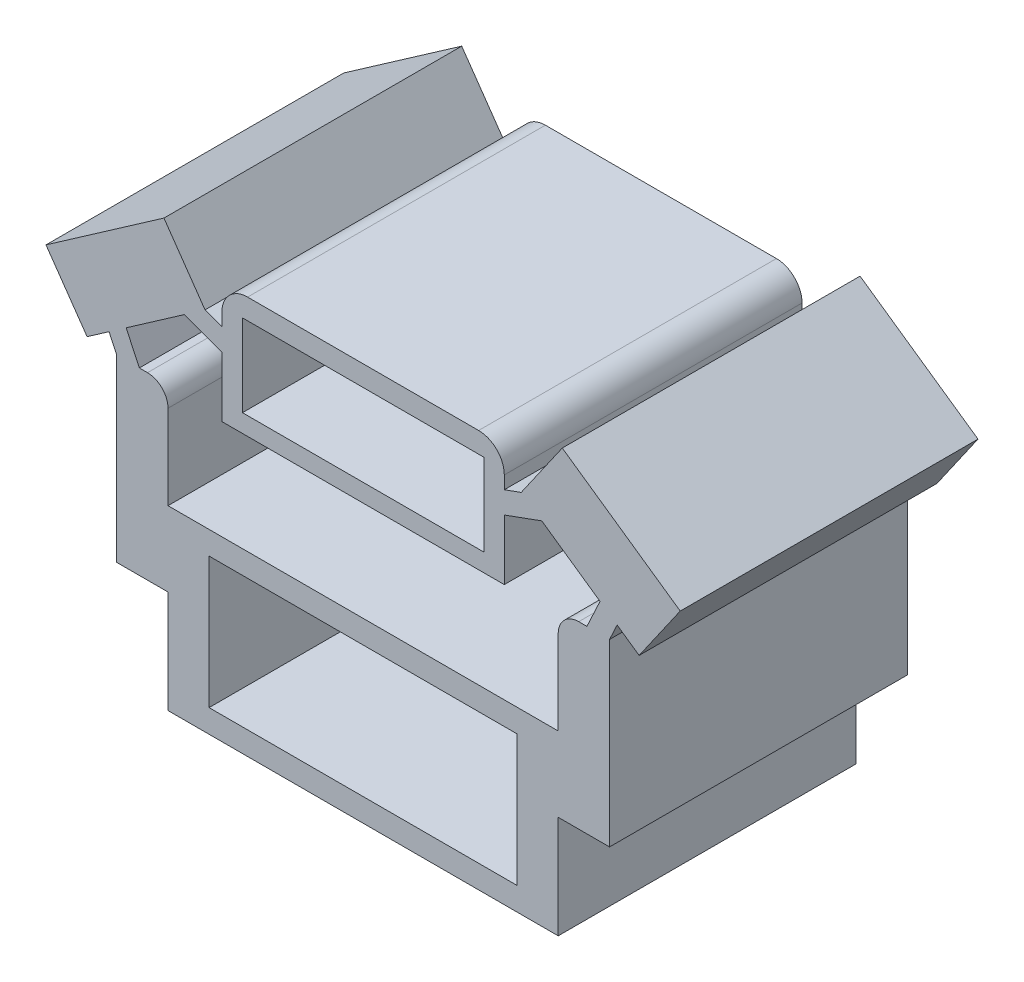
ISO-10303-21;
HEADER;
FILE_DESCRIPTION(('STEP AP214'),'2;1');
FILE_NAME('part.step','',(''),(''),'','','');
FILE_SCHEMA(('AUTOMOTIVE_DESIGN { 1 0 10303 214 1 1 1 1 }'));
ENDSEC;
DATA;
#1=APPLICATION_CONTEXT('core data for automotive mechanical design processes');
#2=APPLICATION_PROTOCOL_DEFINITION('international standard','automotive_design',2000,#1);
#3=PRODUCT_CONTEXT('',#1,'mechanical');
#4=PRODUCT('Part','Part','',(#3));
#5=PRODUCT_RELATED_PRODUCT_CATEGORY('part','',(#4));
#6=PRODUCT_DEFINITION_FORMATION('','',#4);
#7=PRODUCT_DEFINITION_CONTEXT('part definition',#1,'design');
#8=PRODUCT_DEFINITION('design','',#6,#7);
#9=PRODUCT_DEFINITION_SHAPE('','',#8);
#10=(LENGTH_UNIT() NAMED_UNIT(*) SI_UNIT(.MILLI.,.METRE.));
#11=(NAMED_UNIT(*) PLANE_ANGLE_UNIT() SI_UNIT($,.RADIAN.));
#12=(NAMED_UNIT(*) SI_UNIT($,.STERADIAN.) SOLID_ANGLE_UNIT());
#13=UNCERTAINTY_MEASURE_WITH_UNIT(LENGTH_MEASURE(1.E-05),#10,'distance_accuracy_value','');
#14=(GEOMETRIC_REPRESENTATION_CONTEXT(3) GLOBAL_UNCERTAINTY_ASSIGNED_CONTEXT((#13)) GLOBAL_UNIT_ASSIGNED_CONTEXT((#10,
#11,#12)) REPRESENTATION_CONTEXT('',''));
#15=CARTESIAN_POINT('',(0.,0.,0.));
#16=DIRECTION('',(0.,0.,1.));
#17=DIRECTION('',(1.,0.,0.));
#18=AXIS2_PLACEMENT_3D('',#15,#16,#17);
#19=CARTESIAN_POINT('',(0.7296,2.25737253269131,3.4568));
#20=DIRECTION('',(1.,0.,0.));
#21=DIRECTION('',(0.,0.,-1.));
#22=AXIS2_PLACEMENT_3D('',#19,#20,#21);
#23=PLANE('',#22);
#24=DIRECTION('',(0.,-1.,0.));
#25=VECTOR('',#24,1.);
#26=CARTESIAN_POINT('',(0.7296,2.25737253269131,2.3432));
#27=LINE('',#26,#25);
#28=CARTESIAN_POINT('',(0.7296,2.60297253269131,2.3432));
#29=VERTEX_POINT('',#28);
#30=CARTESIAN_POINT('',(0.7296,2.28737253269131,2.3432));
#31=VERTEX_POINT('',#30);
#32=EDGE_CURVE('E59',#29,#31,#27,.T.);
#33=ORIENTED_EDGE('',*,*,#32,.T.);
#34=DIRECTION('',(0.,0.,1.));
#35=VECTOR('',#34,1.);
#36=CARTESIAN_POINT('',(0.7296,2.28737253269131,0.883691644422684));
#37=LINE('',#36,#35);
#38=CARTESIAN_POINT('',(0.7296,2.28737253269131,3.4568));
#39=VERTEX_POINT('',#38);
#40=EDGE_CURVE('E54',#31,#39,#37,.T.);
#41=ORIENTED_EDGE('',*,*,#40,.T.);
#42=DIRECTION('',(0.,-1.,0.));
#43=VECTOR('',#42,1.);
#44=CARTESIAN_POINT('',(0.7296,2.25737253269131,3.4568));
#45=LINE('',#44,#43);
#46=CARTESIAN_POINT('',(0.7296,2.60297253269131,3.4568));
#47=VERTEX_POINT('',#46);
#48=EDGE_CURVE('E557',#47,#39,#45,.T.);
#49=ORIENTED_EDGE('',*,*,#48,.F.);
#50=DIRECTION('',(0.,0.,-1.));
#51=VECTOR('',#50,1.);
#52=CARTESIAN_POINT('',(0.7296,2.60297253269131,3.4568));
#53=LINE('',#52,#51);
#54=EDGE_CURVE('E47',#47,#29,#53,.T.);
#55=ORIENTED_EDGE('',*,*,#54,.T.);
#56=EDGE_LOOP('',(#33,#41,#49,#55));
#57=FACE_BOUND('',#56,.T.);
#58=ADVANCED_FACE('F39',(#57),#23,.F.);
#59=CARTESIAN_POINT('',(-0.7296,1.71977253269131,3.4568));
#60=DIRECTION('',(1.,0.,0.));
#61=DIRECTION('',(0.,0.,-1.));
#62=AXIS2_PLACEMENT_3D('',#59,#60,#61);
#63=PLANE('',#62);
#64=DIRECTION('',(0.,-1.,0.));
#65=VECTOR('',#64,1.);
#66=CARTESIAN_POINT('',(-0.7296,1.71977253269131,3.4568));
#67=LINE('',#66,#65);
#68=CARTESIAN_POINT('',(-0.7296,2.00777253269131,3.4568));
#69=VERTEX_POINT('',#68);
#70=CARTESIAN_POINT('',(-0.7296,1.62377253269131,3.4568));
#71=VERTEX_POINT('',#70);
#72=EDGE_CURVE('E559',#69,#71,#67,.T.);
#73=ORIENTED_EDGE('',*,*,#72,.F.);
#74=DIRECTION('',(0.,0.,-1.));
#75=VECTOR('',#74,1.);
#76=CARTESIAN_POINT('',(-0.7296,2.00777253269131,3.4568));
#77=LINE('',#76,#75);
#78=CARTESIAN_POINT('',(-0.7296,2.00777253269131,2.3432));
#79=VERTEX_POINT('',#78);
#80=EDGE_CURVE('E494',#69,#79,#77,.T.);
#81=ORIENTED_EDGE('',*,*,#80,.T.);
#82=DIRECTION('',(0.,-1.,0.));
#83=VECTOR('',#82,1.);
#84=CARTESIAN_POINT('',(-0.7296,1.71977253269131,2.3432));
#85=LINE('',#84,#83);
#86=CARTESIAN_POINT('',(-0.7296,1.62377253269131,2.3432));
#87=VERTEX_POINT('',#86);
#88=EDGE_CURVE('E597',#79,#87,#85,.T.);
#89=ORIENTED_EDGE('',*,*,#88,.T.);
#90=DIRECTION('',(0.,0.,1.));
#91=VECTOR('',#90,1.);
#92=CARTESIAN_POINT('',(-0.7296,1.62377253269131,0.880845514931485));
#93=LINE('',#92,#91);
#94=EDGE_CURVE('E403',#87,#71,#93,.T.);
#95=ORIENTED_EDGE('',*,*,#94,.T.);
#96=EDGE_LOOP('',(#73,#81,#89,#95));
#97=FACE_BOUND('',#96,.T.);
#98=ADVANCED_FACE('F789',(#97),#63,.F.);
#99=CARTESIAN_POINT('',(0.7296,1.71977253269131,3.4568));
#100=DIRECTION('',(-1.,0.,0.));
#101=DIRECTION('',(0.,0.,1.));
#102=AXIS2_PLACEMENT_3D('',#99,#100,#101);
#103=PLANE('',#102);
#104=DIRECTION('',(0.,1.,0.));
#105=VECTOR('',#104,1.);
#106=CARTESIAN_POINT('',(0.7296,1.71977253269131,2.3432));
#107=LINE('',#106,#105);
#108=CARTESIAN_POINT('',(0.7296,1.62377253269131,2.3432));
#109=VERTEX_POINT('',#108);
#110=CARTESIAN_POINT('',(0.7296,2.00777253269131,2.3432));
#111=VERTEX_POINT('',#110);
#112=EDGE_CURVE('E599',#109,#111,#107,.T.);
#113=ORIENTED_EDGE('',*,*,#112,.T.);
#114=DIRECTION('',(0.,0.,-1.));
#115=VECTOR('',#114,1.);
#116=CARTESIAN_POINT('',(0.7296,2.00777253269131,3.4568));
#117=LINE('',#116,#115);
#118=CARTESIAN_POINT('',(0.7296,2.00777253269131,3.4568));
#119=VERTEX_POINT('',#118);
#120=EDGE_CURVE('E675',#119,#111,#117,.T.);
#121=ORIENTED_EDGE('',*,*,#120,.F.);
#122=DIRECTION('',(0.,1.,0.));
#123=VECTOR('',#122,1.);
#124=CARTESIAN_POINT('',(0.7296,1.71977253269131,3.4568));
#125=LINE('',#124,#123);
#126=CARTESIAN_POINT('',(0.7296,1.62377253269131,3.4568));
#127=VERTEX_POINT('',#126);
#128=EDGE_CURVE('E562',#127,#119,#125,.T.);
#129=ORIENTED_EDGE('',*,*,#128,.F.);
#130=DIRECTION('',(0.,0.,1.));
#131=VECTOR('',#130,1.);
#132=CARTESIAN_POINT('',(0.7296,1.62377253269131,0.880845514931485));
#133=LINE('',#132,#131);
#134=EDGE_CURVE('E400',#109,#127,#133,.T.);
#135=ORIENTED_EDGE('',*,*,#134,.F.);
#136=EDGE_LOOP('',(#113,#121,#129,#135));
#137=FACE_BOUND('',#136,.T.);
#138=ADVANCED_FACE('F794',(#137),#103,.F.);
#139=CARTESIAN_POINT('',(0.7296,2.00777253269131,3.4568));
#140=DIRECTION('',(0.,1.,0.));
#141=DIRECTION('',(0.,0.,1.));
#142=AXIS2_PLACEMENT_3D('',#139,#140,#141);
#143=PLANE('',#142);
#144=DIRECTION('',(1.,0.,0.));
#145=VECTOR('',#144,1.);
#146=CARTESIAN_POINT('',(0.7296,2.00777253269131,2.3432));
#147=LINE('',#146,#145);
#148=CARTESIAN_POINT('',(0.9216,2.00777253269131,2.3432));
#149=VERTEX_POINT('',#148);
#150=EDGE_CURVE('E601',#111,#149,#147,.T.);
#151=ORIENTED_EDGE('',*,*,#150,.T.);
#152=DIRECTION('',(0.,0.,-1.));
#153=VECTOR('',#152,1.);
#154=CARTESIAN_POINT('',(0.9216,2.00777253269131,3.4568));
#155=LINE('',#154,#153);
#156=CARTESIAN_POINT('',(0.9216,2.00777253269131,3.4568));
#157=VERTEX_POINT('',#156);
#158=EDGE_CURVE('E672',#157,#149,#155,.T.);
#159=ORIENTED_EDGE('',*,*,#158,.F.);
#160=DIRECTION('',(1.,0.,0.));
#161=VECTOR('',#160,1.);
#162=CARTESIAN_POINT('',(0.7296,2.00777253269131,3.4568));
#163=LINE('',#162,#161);
#164=EDGE_CURVE('E564',#119,#157,#163,.T.);
#165=ORIENTED_EDGE('',*,*,#164,.F.);
#166=ORIENTED_EDGE('',*,*,#120,.T.);
#167=EDGE_LOOP('',(#151,#159,#165,#166));
#168=FACE_BOUND('',#167,.T.);
#169=ADVANCED_FACE('F1067',(#168),#143,.F.);
#170=CARTESIAN_POINT('',(0.9216,2.67977253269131,3.4568));
#171=DIRECTION('',(-1.,0.,0.));
#172=DIRECTION('',(0.,-1.,0.));
#173=AXIS2_PLACEMENT_3D('',#170,#171,#172);
#174=PLANE('',#173);
#175=DIRECTION('',(0.,1.,0.));
#176=VECTOR('',#175,1.);
#177=CARTESIAN_POINT('',(0.9216,2.67977253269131,2.3432));
#178=LINE('',#177,#176);
#179=CARTESIAN_POINT('',(0.9216,2.67977253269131,2.3432));
#180=VERTEX_POINT('',#179);
#181=EDGE_CURVE('E603',#149,#180,#178,.T.);
#182=ORIENTED_EDGE('',*,*,#181,.T.);
#183=DIRECTION('',(0.,0.,-1.));
#184=VECTOR('',#183,1.);
#185=CARTESIAN_POINT('',(0.9216,2.67977253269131,3.4568));
#186=LINE('',#185,#184);
#187=CARTESIAN_POINT('',(0.9216,2.67977253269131,3.4568));
#188=VERTEX_POINT('',#187);
#189=EDGE_CURVE('E669',#188,#180,#186,.T.);
#190=ORIENTED_EDGE('',*,*,#189,.F.);
#191=DIRECTION('',(0.,1.,0.));
#192=VECTOR('',#191,1.);
#193=CARTESIAN_POINT('',(0.9216,2.67977253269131,3.4568));
#194=LINE('',#193,#192);
#195=EDGE_CURVE('E566',#157,#188,#194,.T.);
#196=ORIENTED_EDGE('',*,*,#195,.F.);
#197=ORIENTED_EDGE('',*,*,#158,.T.);
#198=EDGE_LOOP('',(#182,#190,#196,#197));
#199=FACE_BOUND('',#198,.T.);
#200=ADVANCED_FACE('F1239',(#199),#174,.F.);
#201=CARTESIAN_POINT('',(0.9216,2.67977253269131,3.4568));
#202=DIRECTION('',(-0.906307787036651,0.422618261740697,0.));
#203=DIRECTION('',(-0.422618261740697,-0.906307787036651,0.));
#204=AXIS2_PLACEMENT_3D('',#201,#202,#203);
#205=PLANE('',#204);
#206=DIRECTION('',(0.422618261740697,0.906307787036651,0.));
#207=VECTOR('',#206,1.);
#208=CARTESIAN_POINT('',(0.9216,2.67977253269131,2.3432));
#209=LINE('',#208,#207);
#210=CARTESIAN_POINT('',(0.949999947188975,2.74067641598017,2.3432));
#211=VERTEX_POINT('',#210);
#212=EDGE_CURVE('E605',#180,#211,#209,.T.);
#213=ORIENTED_EDGE('',*,*,#212,.T.);
#214=DIRECTION('',(0.,0.,-1.));
#215=VECTOR('',#214,1.);
#216=CARTESIAN_POINT('',(0.949999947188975,2.74067641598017,3.4568));
#217=LINE('',#216,#215);
#218=CARTESIAN_POINT('',(0.949999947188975,2.74067641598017,3.4568));
#219=VERTEX_POINT('',#218);
#220=EDGE_CURVE('E666',#219,#211,#217,.T.);
#221=ORIENTED_EDGE('',*,*,#220,.F.);
#222=DIRECTION('',(0.422618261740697,0.906307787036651,0.));
#223=VECTOR('',#222,1.);
#224=CARTESIAN_POINT('',(0.9216,2.67977253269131,3.4568));
#225=LINE('',#224,#223);
#226=EDGE_CURVE('E568',#188,#219,#225,.T.);
#227=ORIENTED_EDGE('',*,*,#226,.F.);
#228=ORIENTED_EDGE('',*,*,#189,.T.);
#229=EDGE_LOOP('',(#213,#221,#227,#228));
#230=FACE_BOUND('',#229,.T.);
#231=ADVANCED_FACE('F1229',(#230),#205,.F.);
#232=CARTESIAN_POINT('',(0.949999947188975,2.74067641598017,3.4568));
#233=DIRECTION('',(0.571747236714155,0.820429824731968,0.));
#234=DIRECTION('',(-0.820429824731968,0.571747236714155,0.));
#235=AXIS2_PLACEMENT_3D('',#232,#233,#234);
#236=PLANE('',#235);
#237=DIRECTION('',(0.820429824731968,-0.571747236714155,0.));
#238=VECTOR('',#237,1.);
#239=CARTESIAN_POINT('',(0.949999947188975,2.74067641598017,2.3432));
#240=LINE('',#239,#238);
#241=CARTESIAN_POINT('',(1.03221041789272,2.68338497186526,2.3432));
#242=VERTEX_POINT('',#241);
#243=EDGE_CURVE('E607',#211,#242,#240,.T.);
#244=ORIENTED_EDGE('',*,*,#243,.T.);
#245=DIRECTION('',(0.,0.,-1.));
#246=VECTOR('',#245,1.);
#247=CARTESIAN_POINT('',(1.03221041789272,2.68338497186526,3.4568));
#248=LINE('',#247,#246);
#249=CARTESIAN_POINT('',(1.03221041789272,2.68338497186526,3.4568));
#250=VERTEX_POINT('',#249);
#251=EDGE_CURVE('E663',#250,#242,#248,.T.);
#252=ORIENTED_EDGE('',*,*,#251,.F.);
#253=DIRECTION('',(0.820429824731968,-0.571747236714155,0.));
#254=VECTOR('',#253,1.);
#255=CARTESIAN_POINT('',(0.949999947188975,2.74067641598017,3.4568));
#256=LINE('',#255,#254);
#257=EDGE_CURVE('E570',#219,#250,#256,.T.);
#258=ORIENTED_EDGE('',*,*,#257,.F.);
#259=ORIENTED_EDGE('',*,*,#220,.T.);
#260=EDGE_LOOP('',(#244,#252,#258,#259));
#261=FACE_BOUND('',#260,.T.);
#262=ADVANCED_FACE('F1219',(#261),#236,.F.);
#263=CARTESIAN_POINT('',(1.03221041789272,2.68338497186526,3.4568));
#264=DIRECTION('',(-0.820429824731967,0.571747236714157,0.));
#265=DIRECTION('',(-0.571747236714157,-0.820429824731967,0.));
#266=AXIS2_PLACEMENT_3D('',#263,#264,#265);
#267=PLANE('',#266);
#268=DIRECTION('',(0.571747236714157,0.820429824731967,0.));
#269=VECTOR('',#268,1.);
#270=CARTESIAN_POINT('',(1.03221041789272,2.68338497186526,2.3432));
#271=LINE('',#270,#269);
#272=CARTESIAN_POINT('',(1.18589607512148,2.90391650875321,2.3432));
#273=VERTEX_POINT('',#272);
#274=EDGE_CURVE('E609',#242,#273,#271,.T.);
#275=ORIENTED_EDGE('',*,*,#274,.T.);
#276=DIRECTION('',(0.,0.,-1.));
#277=VECTOR('',#276,1.);
#278=CARTESIAN_POINT('',(1.18589607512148,2.90391650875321,3.4568));
#279=LINE('',#278,#277);
#280=CARTESIAN_POINT('',(1.18589607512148,2.90391650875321,3.4568));
#281=VERTEX_POINT('',#280);
#282=EDGE_CURVE('E660',#281,#273,#279,.T.);
#283=ORIENTED_EDGE('',*,*,#282,.F.);
#284=DIRECTION('',(0.571747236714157,0.820429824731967,0.));
#285=VECTOR('',#284,1.);
#286=CARTESIAN_POINT('',(1.03221041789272,2.68338497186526,3.4568));
#287=LINE('',#286,#285);
#288=EDGE_CURVE('E572',#250,#281,#287,.T.);
#289=ORIENTED_EDGE('',*,*,#288,.F.);
#290=ORIENTED_EDGE('',*,*,#251,.T.);
#291=EDGE_LOOP('',(#275,#283,#289,#290));
#292=FACE_BOUND('',#291,.T.);
#293=ADVANCED_FACE('F1209',(#292),#267,.F.);
#294=CARTESIAN_POINT('',(0.744833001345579,3.21128782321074,3.4568));
#295=DIRECTION('',(-0.571747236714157,-0.820429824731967,0.));
#296=DIRECTION('',(0.820429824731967,-0.571747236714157,0.));
#297=AXIS2_PLACEMENT_3D('',#294,#295,#296);
#298=PLANE('',#297);
#299=DIRECTION('',(-0.820429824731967,0.571747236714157,0.));
#300=VECTOR('',#299,1.);
#301=CARTESIAN_POINT('',(0.744833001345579,3.21128782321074,2.3432));
#302=LINE('',#301,#300);
#303=CARTESIAN_POINT('',(0.744833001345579,3.21128782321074,2.3432));
#304=VERTEX_POINT('',#303);
#305=EDGE_CURVE('E611',#273,#304,#302,.T.);
#306=ORIENTED_EDGE('',*,*,#305,.T.);
#307=DIRECTION('',(0.,0.,-1.));
#308=VECTOR('',#307,1.);
#309=CARTESIAN_POINT('',(0.744833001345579,3.21128782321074,3.4568));
#310=LINE('',#309,#308);
#311=CARTESIAN_POINT('',(0.744833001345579,3.21128782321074,3.4568));
#312=VERTEX_POINT('',#311);
#313=EDGE_CURVE('E657',#312,#304,#310,.T.);
#314=ORIENTED_EDGE('',*,*,#313,.F.);
#315=DIRECTION('',(-0.820429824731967,0.571747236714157,0.));
#316=VECTOR('',#315,1.);
#317=CARTESIAN_POINT('',(0.744833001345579,3.21128782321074,3.4568));
#318=LINE('',#317,#316);
#319=EDGE_CURVE('E574',#281,#312,#318,.T.);
#320=ORIENTED_EDGE('',*,*,#319,.F.);
#321=ORIENTED_EDGE('',*,*,#282,.T.);
#322=EDGE_LOOP('',(#306,#314,#320,#321));
#323=FACE_BOUND('',#322,.T.);
#324=ADVANCED_FACE('F1199',(#323),#298,.F.);
#325=CARTESIAN_POINT('',(0.744833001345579,3.21128782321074,3.4568));
#326=DIRECTION('',(0.820429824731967,-0.571747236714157,0.));
#327=DIRECTION('',(0.571747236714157,0.820429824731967,0.));
#328=AXIS2_PLACEMENT_3D('',#325,#326,#327);
#329=PLANE('',#328);
#330=DIRECTION('',(-0.571747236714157,-0.820429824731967,0.));
#331=VECTOR('',#330,1.);
#332=CARTESIAN_POINT('',(0.744833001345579,3.21128782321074,2.3432));
#333=LINE('',#332,#331);
#334=CARTESIAN_POINT('',(0.591147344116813,2.99075628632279,2.3432));
#335=VERTEX_POINT('',#334);
#336=EDGE_CURVE('E613',#304,#335,#333,.T.);
#337=ORIENTED_EDGE('',*,*,#336,.T.);
#338=DIRECTION('',(0.,0.,-1.));
#339=VECTOR('',#338,1.);
#340=CARTESIAN_POINT('',(0.591147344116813,2.99075628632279,3.4568));
#341=LINE('',#340,#339);
#342=CARTESIAN_POINT('',(0.591147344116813,2.99075628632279,3.4568));
#343=VERTEX_POINT('',#342);
#344=EDGE_CURVE('E654',#343,#335,#341,.T.);
#345=ORIENTED_EDGE('',*,*,#344,.F.);
#346=DIRECTION('',(-0.571747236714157,-0.820429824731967,0.));
#347=VECTOR('',#346,1.);
#348=CARTESIAN_POINT('',(0.744833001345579,3.21128782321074,3.4568));
#349=LINE('',#348,#347);
#350=EDGE_CURVE('E576',#312,#343,#349,.T.);
#351=ORIENTED_EDGE('',*,*,#350,.F.);
#352=ORIENTED_EDGE('',*,*,#313,.T.);
#353=EDGE_LOOP('',(#337,#345,#351,#352));
#354=FACE_BOUND('',#353,.T.);
#355=ADVANCED_FACE('F1189',(#354),#329,.F.);
#356=CARTESIAN_POINT('',(0.528,2.96777253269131,3.4568));
#357=DIRECTION('',(0.342020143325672,-0.939692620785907,0.));
#358=DIRECTION('',(0.939692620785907,0.342020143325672,0.));
#359=AXIS2_PLACEMENT_3D('',#356,#357,#358);
#360=PLANE('',#359);
#361=DIRECTION('',(-0.939692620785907,-0.342020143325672,0.));
#362=VECTOR('',#361,1.);
#363=CARTESIAN_POINT('',(0.528,2.96777253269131,2.3432));
#364=LINE('',#363,#362);
#365=CARTESIAN_POINT('',(0.528,2.96777253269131,2.3432));
#366=VERTEX_POINT('',#365);
#367=EDGE_CURVE('E615',#335,#366,#364,.T.);
#368=ORIENTED_EDGE('',*,*,#367,.T.);
#369=DIRECTION('',(0.,0.,-1.));
#370=VECTOR('',#369,1.);
#371=CARTESIAN_POINT('',(0.528,2.96777253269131,3.4568));
#372=LINE('',#371,#370);
#373=CARTESIAN_POINT('',(0.528,2.96777253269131,3.4568));
#374=VERTEX_POINT('',#373);
#375=EDGE_CURVE('E651',#374,#366,#372,.T.);
#376=ORIENTED_EDGE('',*,*,#375,.F.);
#377=DIRECTION('',(-0.939692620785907,-0.342020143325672,0.));
#378=VECTOR('',#377,1.);
#379=CARTESIAN_POINT('',(0.528,2.96777253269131,3.4568));
#380=LINE('',#379,#378);
#381=EDGE_CURVE('E578',#343,#374,#380,.T.);
#382=ORIENTED_EDGE('',*,*,#381,.F.);
#383=ORIENTED_EDGE('',*,*,#344,.T.);
#384=EDGE_LOOP('',(#368,#376,#382,#383));
#385=FACE_BOUND('',#384,.T.);
#386=ADVANCED_FACE('F1180',(#385),#360,.F.);
#387=CARTESIAN_POINT('',(-0.528,2.96777253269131,3.4568));
#388=DIRECTION('',(1.,0.,0.));
#389=DIRECTION('',(0.,0.,-1.));
#390=AXIS2_PLACEMENT_3D('',#387,#388,#389);
#391=PLANE('',#390);
#392=DIRECTION('',(0.,-1.,0.));
#393=VECTOR('',#392,1.);
#394=CARTESIAN_POINT('',(-0.528,2.96777253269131,3.4568));
#395=LINE('',#394,#393);
#396=CARTESIAN_POINT('',(-0.528,2.88604367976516,3.4568));
#397=VERTEX_POINT('',#396);
#398=CARTESIAN_POINT('',(-0.528,2.66057253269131,3.4568));
#399=VERTEX_POINT('',#398);
#400=EDGE_CURVE('E580',#397,#399,#395,.T.);
#401=ORIENTED_EDGE('',*,*,#400,.F.);
#402=DIRECTION('',(0.,0.,-1.));
#403=VECTOR('',#402,1.);
#404=CARTESIAN_POINT('',(-0.528,2.88604367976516,3.4568));
#405=LINE('',#404,#403);
#406=CARTESIAN_POINT('',(-0.528,2.88604367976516,2.3432));
#407=VERTEX_POINT('',#406);
#408=EDGE_CURVE('E548',#397,#407,#405,.T.);
#409=ORIENTED_EDGE('',*,*,#408,.T.);
#410=DIRECTION('',(0.,-1.,0.));
#411=VECTOR('',#410,1.);
#412=CARTESIAN_POINT('',(-0.528,2.96777253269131,2.3432));
#413=LINE('',#412,#411);
#414=CARTESIAN_POINT('',(-0.528,2.66057253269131,2.3432));
#415=VERTEX_POINT('',#414);
#416=EDGE_CURVE('E617',#407,#415,#413,.T.);
#417=ORIENTED_EDGE('',*,*,#416,.T.);
#418=DIRECTION('',(0.,0.,-1.));
#419=VECTOR('',#418,1.);
#420=CARTESIAN_POINT('',(-0.528,2.66057253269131,3.4568));
#421=LINE('',#420,#419);
#422=EDGE_CURVE('E645',#399,#415,#421,.T.);
#423=ORIENTED_EDGE('',*,*,#422,.F.);
#424=EDGE_LOOP('',(#401,#409,#417,#423));
#425=FACE_BOUND('',#424,.T.);
#426=ADVANCED_FACE('F755',(#425),#391,.F.);
#427=CARTESIAN_POINT('',(-0.528,2.66057253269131,3.4568));
#428=DIRECTION('',(0.,1.,0.));
#429=DIRECTION('',(-1.,0.,0.));
#430=AXIS2_PLACEMENT_3D('',#427,#428,#429);
#431=PLANE('',#430);
#432=DIRECTION('',(1.,0.,0.));
#433=VECTOR('',#432,1.);
#434=CARTESIAN_POINT('',(-0.528,2.66057253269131,2.3432));
#435=LINE('',#434,#433);
#436=CARTESIAN_POINT('',(0.528,2.66057253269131,2.3432));
#437=VERTEX_POINT('',#436);
#438=EDGE_CURVE('E619',#415,#437,#435,.T.);
#439=ORIENTED_EDGE('',*,*,#438,.T.);
#440=DIRECTION('',(0.,0.,-1.));
#441=VECTOR('',#440,1.);
#442=CARTESIAN_POINT('',(0.528,2.66057253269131,3.4568));
#443=LINE('',#442,#441);
#444=CARTESIAN_POINT('',(0.528,2.66057253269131,3.4568));
#445=VERTEX_POINT('',#444);
#446=EDGE_CURVE('E642',#445,#437,#443,.T.);
#447=ORIENTED_EDGE('',*,*,#446,.F.);
#448=DIRECTION('',(1.,0.,0.));
#449=VECTOR('',#448,1.);
#450=CARTESIAN_POINT('',(-0.528,2.66057253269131,3.4568));
#451=LINE('',#450,#449);
#452=EDGE_CURVE('E582',#399,#445,#451,.T.);
#453=ORIENTED_EDGE('',*,*,#452,.F.);
#454=ORIENTED_EDGE('',*,*,#422,.T.);
#455=EDGE_LOOP('',(#439,#447,#453,#454));
#456=FACE_BOUND('',#455,.T.);
#457=ADVANCED_FACE('F752',(#456),#431,.F.);
#458=CARTESIAN_POINT('',(0.528,2.88604367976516,3.4568));
#459=DIRECTION('',(-1.,0.,0.));
#460=DIRECTION('',(0.,0.,1.));
#461=AXIS2_PLACEMENT_3D('',#458,#459,#460);
#462=PLANE('',#461);
#463=DIRECTION('',(0.,1.,0.));
#464=VECTOR('',#463,1.);
#465=CARTESIAN_POINT('',(0.528,2.88604367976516,2.3432));
#466=LINE('',#465,#464);
#467=CARTESIAN_POINT('',(0.528,2.88604367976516,2.3432));
#468=VERTEX_POINT('',#467);
#469=EDGE_CURVE('E621',#437,#468,#466,.T.);
#470=ORIENTED_EDGE('',*,*,#469,.T.);
#471=DIRECTION('',(0.,0.,-1.));
#472=VECTOR('',#471,1.);
#473=CARTESIAN_POINT('',(0.528,2.88604367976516,3.4568));
#474=LINE('',#473,#472);
#475=CARTESIAN_POINT('',(0.528,2.88604367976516,3.4568));
#476=VERTEX_POINT('',#475);
#477=EDGE_CURVE('E639',#476,#468,#474,.T.);
#478=ORIENTED_EDGE('',*,*,#477,.F.);
#479=DIRECTION('',(0.,1.,0.));
#480=VECTOR('',#479,1.);
#481=CARTESIAN_POINT('',(0.528,2.88604367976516,3.4568));
#482=LINE('',#481,#480);
#483=EDGE_CURVE('E584',#445,#476,#482,.T.);
#484=ORIENTED_EDGE('',*,*,#483,.F.);
#485=ORIENTED_EDGE('',*,*,#446,.T.);
#486=EDGE_LOOP('',(#470,#478,#484,#485));
#487=FACE_BOUND('',#486,.T.);
#488=ADVANCED_FACE('F747',(#487),#462,.F.);
#489=CARTESIAN_POINT('',(0.528,2.88604367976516,3.4568));
#490=DIRECTION('',(-0.342020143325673,0.939692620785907,0.));
#491=DIRECTION('',(-0.939692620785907,-0.342020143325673,0.));
#492=AXIS2_PLACEMENT_3D('',#489,#490,#491);
#493=PLANE('',#492);
#494=DIRECTION('',(0.939692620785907,0.342020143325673,0.));
#495=VECTOR('',#494,1.);
#496=CARTESIAN_POINT('',(0.528,2.88604367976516,2.3432));
#497=LINE('',#496,#495);
#498=CARTESIAN_POINT('',(0.668187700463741,2.93706782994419,2.3432));
#499=VERTEX_POINT('',#498);
#500=EDGE_CURVE('E623',#468,#499,#497,.T.);
#501=ORIENTED_EDGE('',*,*,#500,.T.);
#502=DIRECTION('',(0.,0.,-1.));
#503=VECTOR('',#502,1.);
#504=CARTESIAN_POINT('',(0.668187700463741,2.93706782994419,3.4568));
#505=LINE('',#504,#503);
#506=CARTESIAN_POINT('',(0.668187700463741,2.93706782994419,3.4568));
#507=VERTEX_POINT('',#506);
#508=EDGE_CURVE('E636',#507,#499,#505,.T.);
#509=ORIENTED_EDGE('',*,*,#508,.F.);
#510=DIRECTION('',(0.939692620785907,0.342020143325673,0.));
#511=VECTOR('',#510,1.);
#512=CARTESIAN_POINT('',(0.528,2.88604367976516,3.4568));
#513=LINE('',#512,#511);
#514=EDGE_CURVE('E586',#476,#507,#513,.T.);
#515=ORIENTED_EDGE('',*,*,#514,.F.);
#516=ORIENTED_EDGE('',*,*,#477,.T.);
#517=EDGE_LOOP('',(#501,#509,#515,#516));
#518=FACE_BOUND('',#517,.T.);
#519=ADVANCED_FACE('F742',(#518),#493,.F.);
#520=CARTESIAN_POINT('',(0.668187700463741,2.93706782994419,3.4568));
#521=DIRECTION('',(0.571747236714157,0.820429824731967,0.));
#522=DIRECTION('',(-0.820429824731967,0.571747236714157,0.));
#523=AXIS2_PLACEMENT_3D('',#520,#521,#522);
#524=PLANE('',#523);
#525=DIRECTION('',(0.820429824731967,-0.571747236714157,0.));
#526=VECTOR('',#525,1.);
#527=CARTESIAN_POINT('',(0.668187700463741,2.93706782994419,2.3432));
#528=LINE('',#527,#526);
#529=CARTESIAN_POINT('',(0.886043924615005,2.78524656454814,2.3432));
#530=VERTEX_POINT('',#529);
#531=EDGE_CURVE('E625',#499,#530,#528,.T.);
#532=ORIENTED_EDGE('',*,*,#531,.T.);
#533=DIRECTION('',(0.,0.,-1.));
#534=VECTOR('',#533,1.);
#535=CARTESIAN_POINT('',(0.886043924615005,2.78524656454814,3.4568));
#536=LINE('',#535,#534);
#537=CARTESIAN_POINT('',(0.886043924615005,2.78524656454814,3.4568));
#538=VERTEX_POINT('',#537);
#539=EDGE_CURVE('E633',#538,#530,#536,.T.);
#540=ORIENTED_EDGE('',*,*,#539,.F.);
#541=DIRECTION('',(0.820429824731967,-0.571747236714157,0.));
#542=VECTOR('',#541,1.);
#543=CARTESIAN_POINT('',(0.668187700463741,2.93706782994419,3.4568));
#544=LINE('',#543,#542);
#545=EDGE_CURVE('E588',#507,#538,#544,.T.);
#546=ORIENTED_EDGE('',*,*,#545,.F.);
#547=ORIENTED_EDGE('',*,*,#508,.T.);
#548=EDGE_LOOP('',(#532,#540,#546,#547));
#549=FACE_BOUND('',#548,.T.);
#550=ADVANCED_FACE('F738',(#549),#524,.F.);
#551=CARTESIAN_POINT('',(0.836860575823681,2.67977253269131,3.4568));
#552=DIRECTION('',(0.906307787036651,-0.422618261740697,0.));
#553=DIRECTION('',(0.422618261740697,0.906307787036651,0.));
#554=AXIS2_PLACEMENT_3D('',#551,#552,#553);
#555=PLANE('',#554);
#556=DIRECTION('',(-0.422618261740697,-0.906307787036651,0.));
#557=VECTOR('',#556,1.);
#558=CARTESIAN_POINT('',(0.836860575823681,2.67977253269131,2.3432));
#559=LINE('',#558,#557);
#560=CARTESIAN_POINT('',(0.836860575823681,2.67977253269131,2.3432));
#561=VERTEX_POINT('',#560);
#562=EDGE_CURVE('E627',#530,#561,#559,.T.);
#563=ORIENTED_EDGE('',*,*,#562,.T.);
#564=DIRECTION('',(0.,0.,-1.));
#565=VECTOR('',#564,1.);
#566=CARTESIAN_POINT('',(0.836860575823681,2.67977253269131,3.4568));
#567=LINE('',#566,#565);
#568=CARTESIAN_POINT('',(0.836860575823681,2.67977253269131,3.4568));
#569=VERTEX_POINT('',#568);
#570=EDGE_CURVE('E595',#569,#561,#567,.T.);
#571=ORIENTED_EDGE('',*,*,#570,.F.);
#572=DIRECTION('',(-0.422618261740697,-0.906307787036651,0.));
#573=VECTOR('',#572,1.);
#574=CARTESIAN_POINT('',(0.836860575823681,2.67977253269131,3.4568));
#575=LINE('',#574,#573);
#576=EDGE_CURVE('E590',#538,#569,#575,.T.);
#577=ORIENTED_EDGE('',*,*,#576,.F.);
#578=ORIENTED_EDGE('',*,*,#539,.T.);
#579=EDGE_LOOP('',(#563,#571,#577,#578));
#580=FACE_BOUND('',#579,.T.);
#581=ADVANCED_FACE('F733',(#580),#555,.F.);
#582=CARTESIAN_POINT('',(0.7296,2.67977253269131,3.4568));
#583=DIRECTION('',(0.,-1.,0.));
#584=DIRECTION('',(0.,0.,-1.));
#585=AXIS2_PLACEMENT_3D('',#582,#583,#584);
#586=PLANE('',#585);
#587=DIRECTION('',(-1.,0.,0.));
#588=VECTOR('',#587,1.);
#589=CARTESIAN_POINT('',(0.7296,2.67977253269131,2.3432));
#590=LINE('',#589,#588);
#591=CARTESIAN_POINT('',(0.806400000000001,2.67977253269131,2.3432));
#592=VERTEX_POINT('',#591);
#593=EDGE_CURVE('E560',#561,#592,#590,.T.);
#594=ORIENTED_EDGE('',*,*,#593,.T.);
#595=DIRECTION('',(0.,0.,-1.));
#596=VECTOR('',#595,1.);
#597=CARTESIAN_POINT('',(0.806400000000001,2.67977253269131,3.4568));
#598=LINE('',#597,#596);
#599=CARTESIAN_POINT('',(0.806400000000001,2.67977253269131,3.4568));
#600=VERTEX_POINT('',#599);
#601=EDGE_CURVE('E11',#592,#600,#598,.F.);
#602=ORIENTED_EDGE('',*,*,#601,.T.);
#603=DIRECTION('',(-1.,0.,0.));
#604=VECTOR('',#603,1.);
#605=CARTESIAN_POINT('',(0.7296,2.67977253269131,3.4568));
#606=LINE('',#605,#604);
#607=EDGE_CURVE('E592',#569,#600,#606,.T.);
#608=ORIENTED_EDGE('',*,*,#607,.F.);
#609=ORIENTED_EDGE('',*,*,#570,.T.);
#610=EDGE_LOOP('',(#594,#602,#608,#609));
#611=FACE_BOUND('',#610,.T.);
#612=ADVANCED_FACE('F727',(#611),#586,.F.);
#613=CARTESIAN_POINT('',(0.,1.98857253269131,3.4568));
#614=DIRECTION('',(0.,0.,-1.));
#615=DIRECTION('',(-1.,0.,0.));
#616=AXIS2_PLACEMENT_3D('',#613,#614,#615);
#617=PLANE('',#616);
#618=ORIENTED_EDGE('',*,*,#48,.T.);
#619=DIRECTION('',(-1.,0.,0.));
#620=VECTOR('',#619,1.);
#621=CARTESIAN_POINT('',(-0.7296,2.28737253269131,3.4568));
#622=LINE('',#621,#620);
#623=CARTESIAN_POINT('',(-0.7296,2.28737253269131,3.4568));
#624=VERTEX_POINT('',#623);
#625=EDGE_CURVE('E374',#39,#624,#622,.T.);
#626=ORIENTED_EDGE('',*,*,#625,.T.);
#627=DIRECTION('',(0.,-1.,0.));
#628=VECTOR('',#627,1.);
#629=CARTESIAN_POINT('',(-0.7296,2.25737253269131,3.4568));
#630=LINE('',#629,#628);
#631=CARTESIAN_POINT('',(-0.7296,2.60297253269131,3.4568));
#632=VERTEX_POINT('',#631);
#633=EDGE_CURVE('E455',#632,#624,#630,.T.);
#634=ORIENTED_EDGE('',*,*,#633,.F.);
#635=CARTESIAN_POINT('',(-0.8064,2.60297253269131,3.4568));
#636=DIRECTION('',(0.,0.,-1.));
#637=DIRECTION('',(-1.,0.,0.));
#638=AXIS2_PLACEMENT_3D('',#635,#636,#637);
#639=CIRCLE('',#638,0.0768);
#640=CARTESIAN_POINT('',(-0.8064,2.67977253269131,3.4568));
#641=VERTEX_POINT('',#640);
#642=EDGE_CURVE('E709',#632,#641,#639,.F.);
#643=ORIENTED_EDGE('',*,*,#642,.T.);
#644=DIRECTION('',(1.,0.,0.));
#645=VECTOR('',#644,1.);
#646=CARTESIAN_POINT('',(-0.7296,2.67977253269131,3.4568));
#647=LINE('',#646,#645);
#648=CARTESIAN_POINT('',(-0.83686057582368,2.67977253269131,3.4568));
#649=VERTEX_POINT('',#648);
#650=EDGE_CURVE('E457',#649,#641,#647,.T.);
#651=ORIENTED_EDGE('',*,*,#650,.F.);
#652=DIRECTION('',(0.422618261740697,-0.906307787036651,0.));
#653=VECTOR('',#652,1.);
#654=CARTESIAN_POINT('',(-0.83686057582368,2.67977253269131,3.4568));
#655=LINE('',#654,#653);
#656=CARTESIAN_POINT('',(-0.886043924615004,2.78524656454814,3.4568));
#657=VERTEX_POINT('',#656);
#658=EDGE_CURVE('E461',#657,#649,#655,.T.);
#659=ORIENTED_EDGE('',*,*,#658,.F.);
#660=DIRECTION('',(-0.820429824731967,-0.571747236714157,0.));
#661=VECTOR('',#660,1.);
#662=CARTESIAN_POINT('',(-0.668187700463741,2.93706782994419,3.4568));
#663=LINE('',#662,#661);
#664=CARTESIAN_POINT('',(-0.668187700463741,2.93706782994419,3.4568));
#665=VERTEX_POINT('',#664);
#666=EDGE_CURVE('E464',#665,#657,#663,.T.);
#667=ORIENTED_EDGE('',*,*,#666,.F.);
#668=DIRECTION('',(-0.939692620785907,0.342020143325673,0.));
#669=VECTOR('',#668,1.);
#670=CARTESIAN_POINT('',(-0.528,2.88604367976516,3.4568));
#671=LINE('',#670,#669);
#672=EDGE_CURVE('E467',#397,#665,#671,.T.);
#673=ORIENTED_EDGE('',*,*,#672,.F.);
#674=ORIENTED_EDGE('',*,*,#400,.T.);
#675=ORIENTED_EDGE('',*,*,#452,.T.);
#676=ORIENTED_EDGE('',*,*,#483,.T.);
#677=ORIENTED_EDGE('',*,*,#514,.T.);
#678=ORIENTED_EDGE('',*,*,#545,.T.);
#679=ORIENTED_EDGE('',*,*,#576,.T.);
#680=ORIENTED_EDGE('',*,*,#607,.T.);
#681=CARTESIAN_POINT('',(0.806400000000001,2.60297253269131,3.4568));
#682=DIRECTION('',(0.,0.,-1.));
#683=DIRECTION('',(-1.,0.,0.));
#684=AXIS2_PLACEMENT_3D('',#681,#682,#683);
#685=CIRCLE('',#684,0.0768);
#686=EDGE_CURVE('E707',#600,#47,#685,.F.);
#687=ORIENTED_EDGE('',*,*,#686,.T.);
#688=EDGE_LOOP('',(#618,#626,#634,#643,#651,#659,#667,#673,#674,#675,#676,#677,#678,#679,#680,#687));
#689=FACE_BOUND('',#688,.T.);
#690=DIRECTION('',(0.,-1.,0.));
#691=VECTOR('',#690,1.);
#692=CARTESIAN_POINT('',(-0.576,1.78697253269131,3.4568));
#693=LINE('',#692,#691);
#694=CARTESIAN_POINT('',(-0.576,2.20097253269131,3.4568));
#695=VERTEX_POINT('',#694);
#696=CARTESIAN_POINT('',(-0.576,1.71017253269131,3.4568));
#697=VERTEX_POINT('',#696);
#698=EDGE_CURVE('E356',#695,#697,#693,.T.);
#699=ORIENTED_EDGE('',*,*,#698,.F.);
#700=DIRECTION('',(-1.,0.,0.));
#701=VECTOR('',#700,1.);
#702=CARTESIAN_POINT('',(-0.576,2.20097253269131,3.4568));
#703=LINE('',#702,#701);
#704=CARTESIAN_POINT('',(0.576,2.20097253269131,3.4568));
#705=VERTEX_POINT('',#704);
#706=EDGE_CURVE('E370',#705,#695,#703,.T.);
#707=ORIENTED_EDGE('',*,*,#706,.F.);
#708=DIRECTION('',(0.,1.,0.));
#709=VECTOR('',#708,1.);
#710=CARTESIAN_POINT('',(0.576,1.78697253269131,3.4568));
#711=LINE('',#710,#709);
#712=CARTESIAN_POINT('',(0.576,1.71017253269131,3.4568));
#713=VERTEX_POINT('',#712);
#714=EDGE_CURVE('E361',#713,#705,#711,.T.);
#715=ORIENTED_EDGE('',*,*,#714,.F.);
#716=DIRECTION('',(1.,0.,0.));
#717=VECTOR('',#716,1.);
#718=CARTESIAN_POINT('',(-0.576,1.71017253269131,3.4568));
#719=LINE('',#718,#717);
#720=EDGE_CURVE('E384',#697,#713,#719,.T.);
#721=ORIENTED_EDGE('',*,*,#720,.F.);
#722=EDGE_LOOP('',(#699,#707,#715,#721));
#723=FACE_BOUND('',#722,.T.);
#724=DIRECTION('',(1.,0.,0.));
#725=VECTOR('',#724,1.);
#726=CARTESIAN_POINT('',(0.4512,3.03497253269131,3.4568));
#727=LINE('',#726,#725);
#728=CARTESIAN_POINT('',(-0.4512,3.03497253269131,3.4568));
#729=VERTEX_POINT('',#728);
#730=CARTESIAN_POINT('',(0.4512,3.03497253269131,3.4568));
#731=VERTEX_POINT('',#730);
#732=EDGE_CURVE('E406',#729,#731,#727,.T.);
#733=ORIENTED_EDGE('',*,*,#732,.T.);
#734=DIRECTION('',(0.,1.,0.));
#735=VECTOR('',#734,1.);
#736=CARTESIAN_POINT('',(0.4512,3.03497253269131,3.4568));
#737=LINE('',#736,#735);
#738=CARTESIAN_POINT('',(0.4512,2.72777253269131,3.4568));
#739=VERTEX_POINT('',#738);
#740=EDGE_CURVE('E444',#739,#731,#737,.T.);
#741=ORIENTED_EDGE('',*,*,#740,.F.);
#742=DIRECTION('',(1.,0.,0.));
#743=VECTOR('',#742,1.);
#744=CARTESIAN_POINT('',(-0.4512,2.72777253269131,3.4568));
#745=LINE('',#744,#743);
#746=CARTESIAN_POINT('',(-0.4512,2.72777253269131,3.4568));
#747=VERTEX_POINT('',#746);
#748=EDGE_CURVE('E448',#747,#739,#745,.T.);
#749=ORIENTED_EDGE('',*,*,#748,.F.);
#750=DIRECTION('',(0.,-1.,0.));
#751=VECTOR('',#750,1.);
#752=CARTESIAN_POINT('',(-0.4512,3.03497253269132,3.4568));
#753=LINE('',#752,#751);
#754=EDGE_CURVE('E433',#729,#747,#753,.T.);
#755=ORIENTED_EDGE('',*,*,#754,.F.);
#756=EDGE_LOOP('',(#733,#741,#749,#755));
#757=FACE_BOUND('',#756,.T.);
#758=DIRECTION('',(-1.,0.,0.));
#759=VECTOR('',#758,1.);
#760=CARTESIAN_POINT('',(-0.528,3.11177253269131,3.4568));
#761=LINE('',#760,#759);
#762=CARTESIAN_POINT('',(0.432,3.11177253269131,3.4568));
#763=VERTEX_POINT('',#762);
#764=CARTESIAN_POINT('',(-0.432,3.11177253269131,3.4568));
#765=VERTEX_POINT('',#764);
#766=EDGE_CURVE('E410',#763,#765,#761,.T.);
#767=ORIENTED_EDGE('',*,*,#766,.T.);
#768=CARTESIAN_POINT('',(-0.432,3.01577253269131,3.4568));
#769=DIRECTION('',(0.,0.,-1.));
#770=DIRECTION('',(-1.,0.,0.));
#771=AXIS2_PLACEMENT_3D('',#768,#769,#770);
#772=CIRCLE('',#771,0.096);
#773=CARTESIAN_POINT('',(-0.528,3.01577253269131,3.4568));
#774=VERTEX_POINT('',#773);
#775=EDGE_CURVE('E687',#765,#774,#772,.F.);
#776=ORIENTED_EDGE('',*,*,#775,.T.);
#777=DIRECTION('',(0.,-1.,0.));
#778=VECTOR('',#777,1.);
#779=CARTESIAN_POINT('',(-0.528,2.96777253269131,3.4568));
#780=LINE('',#779,#778);
#781=CARTESIAN_POINT('',(-0.528,2.96777253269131,3.4568));
#782=VERTEX_POINT('',#781);
#783=EDGE_CURVE('E407',#774,#782,#780,.T.);
#784=ORIENTED_EDGE('',*,*,#783,.T.);
#785=DIRECTION('',(0.939692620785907,-0.342020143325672,0.));
#786=VECTOR('',#785,1.);
#787=CARTESIAN_POINT('',(-0.528,2.96777253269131,3.4568));
#788=LINE('',#787,#786);
#789=CARTESIAN_POINT('',(-0.591147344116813,2.99075628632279,3.4568));
#790=VERTEX_POINT('',#789);
#791=EDGE_CURVE('E470',#790,#782,#788,.T.);
#792=ORIENTED_EDGE('',*,*,#791,.F.);
#793=DIRECTION('',(0.571747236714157,-0.820429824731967,0.));
#794=VECTOR('',#793,1.);
#795=CARTESIAN_POINT('',(-0.744833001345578,3.21128782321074,3.4568));
#796=LINE('',#795,#794);
#797=CARTESIAN_POINT('',(-0.744833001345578,3.21128782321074,3.4568));
#798=VERTEX_POINT('',#797);
#799=EDGE_CURVE('E473',#798,#790,#796,.T.);
#800=ORIENTED_EDGE('',*,*,#799,.F.);
#801=DIRECTION('',(0.820429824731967,0.571747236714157,0.));
#802=VECTOR('',#801,1.);
#803=CARTESIAN_POINT('',(-0.744833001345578,3.21128782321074,3.4568));
#804=LINE('',#803,#802);
#805=CARTESIAN_POINT('',(-1.18589607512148,2.90391650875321,3.4568));
#806=VERTEX_POINT('',#805);
#807=EDGE_CURVE('E476',#806,#798,#804,.T.);
#808=ORIENTED_EDGE('',*,*,#807,.F.);
#809=DIRECTION('',(-0.571747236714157,0.820429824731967,0.));
#810=VECTOR('',#809,1.);
#811=CARTESIAN_POINT('',(-1.03221041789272,2.68338497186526,3.4568));
#812=LINE('',#811,#810);
#813=CARTESIAN_POINT('',(-1.03221041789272,2.68338497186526,3.4568));
#814=VERTEX_POINT('',#813);
#815=EDGE_CURVE('E479',#814,#806,#812,.T.);
#816=ORIENTED_EDGE('',*,*,#815,.F.);
#817=DIRECTION('',(-0.820429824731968,-0.571747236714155,0.));
#818=VECTOR('',#817,1.);
#819=CARTESIAN_POINT('',(-0.949999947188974,2.74067641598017,3.4568));
#820=LINE('',#819,#818);
#821=CARTESIAN_POINT('',(-0.949999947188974,2.74067641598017,3.4568));
#822=VERTEX_POINT('',#821);
#823=EDGE_CURVE('E482',#822,#814,#820,.T.);
#824=ORIENTED_EDGE('',*,*,#823,.F.);
#825=DIRECTION('',(-0.422618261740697,0.906307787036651,0.));
#826=VECTOR('',#825,1.);
#827=CARTESIAN_POINT('',(-0.921599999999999,2.67977253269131,3.4568));
#828=LINE('',#827,#826);
#829=CARTESIAN_POINT('',(-0.921599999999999,2.67977253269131,3.4568));
#830=VERTEX_POINT('',#829);
#831=EDGE_CURVE('E485',#830,#822,#828,.T.);
#832=ORIENTED_EDGE('',*,*,#831,.F.);
#833=DIRECTION('',(0.,1.,0.));
#834=VECTOR('',#833,1.);
#835=CARTESIAN_POINT('',(-0.921599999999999,2.67977253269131,3.4568));
#836=LINE('',#835,#834);
#837=CARTESIAN_POINT('',(-0.9216,2.00777253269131,3.4568));
#838=VERTEX_POINT('',#837);
#839=EDGE_CURVE('E488',#838,#830,#836,.T.);
#840=ORIENTED_EDGE('',*,*,#839,.F.);
#841=DIRECTION('',(-1.,0.,0.));
#842=VECTOR('',#841,1.);
#843=CARTESIAN_POINT('',(-0.7296,2.00777253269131,3.4568));
#844=LINE('',#843,#842);
#845=EDGE_CURVE('E491',#69,#838,#844,.T.);
#846=ORIENTED_EDGE('',*,*,#845,.F.);
#847=ORIENTED_EDGE('',*,*,#72,.T.);
#848=DIRECTION('',(1.,0.,0.));
#849=VECTOR('',#848,1.);
#850=CARTESIAN_POINT('',(-0.7296,1.62377253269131,3.4568));
#851=LINE('',#850,#849);
#852=EDGE_CURVE('E392',#71,#127,#851,.T.);
#853=ORIENTED_EDGE('',*,*,#852,.T.);
#854=ORIENTED_EDGE('',*,*,#128,.T.);
#855=ORIENTED_EDGE('',*,*,#164,.T.);
#856=ORIENTED_EDGE('',*,*,#195,.T.);
#857=ORIENTED_EDGE('',*,*,#226,.T.);
#858=ORIENTED_EDGE('',*,*,#257,.T.);
#859=ORIENTED_EDGE('',*,*,#288,.T.);
#860=ORIENTED_EDGE('',*,*,#319,.T.);
#861=ORIENTED_EDGE('',*,*,#350,.T.);
#862=ORIENTED_EDGE('',*,*,#381,.T.);
#863=DIRECTION('',(0.,1.,0.));
#864=VECTOR('',#863,1.);
#865=CARTESIAN_POINT('',(0.528,3.11177253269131,3.4568));
#866=LINE('',#865,#864);
#867=CARTESIAN_POINT('',(0.528,3.01577253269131,3.4568));
#868=VERTEX_POINT('',#867);
#869=EDGE_CURVE('E413',#374,#868,#866,.T.);
#870=ORIENTED_EDGE('',*,*,#869,.T.);
#871=CARTESIAN_POINT('',(0.432,3.01577253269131,3.4568));
#872=DIRECTION('',(0.,0.,-1.));
#873=DIRECTION('',(-1.,0.,0.));
#874=AXIS2_PLACEMENT_3D('',#871,#872,#873);
#875=CIRCLE('',#874,0.096);
#876=EDGE_CURVE('E685',#868,#763,#875,.F.);
#877=ORIENTED_EDGE('',*,*,#876,.T.);
#878=EDGE_LOOP('',(#767,#776,#784,#792,#800,#808,#816,#824,#832,#840,#846,#847,#853,#854,#855,
#856,#857,#858,#859,#860,#861,#862,#870,#877));
#879=FACE_BOUND('',#878,.T.);
#880=ADVANCED_FACE('F721',(#689,#723,#757,#879),#617,.F.);
#881=CARTESIAN_POINT('',(0.,1.98857253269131,2.3432));
#882=DIRECTION('',(0.,0.,-1.));
#883=DIRECTION('',(-1.,0.,0.));
#884=AXIS2_PLACEMENT_3D('',#881,#882,#883);
#885=PLANE('',#884);
#886=DIRECTION('',(-1.,0.,0.));
#887=VECTOR('',#886,1.);
#888=CARTESIAN_POINT('',(-0.576,2.20097253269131,2.3432));
#889=LINE('',#888,#887);
#890=CARTESIAN_POINT('',(0.576,2.20097253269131,2.3432));
#891=VERTEX_POINT('',#890);
#892=CARTESIAN_POINT('',(-0.576,2.20097253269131,2.3432));
#893=VERTEX_POINT('',#892);
#894=EDGE_CURVE('E349',#891,#893,#889,.T.);
#895=ORIENTED_EDGE('',*,*,#894,.T.);
#896=DIRECTION('',(0.,-1.,0.));
#897=VECTOR('',#896,1.);
#898=CARTESIAN_POINT('',(-0.576,1.78697253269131,2.3432));
#899=LINE('',#898,#897);
#900=CARTESIAN_POINT('',(-0.576,1.71017253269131,2.3432));
#901=VERTEX_POINT('',#900);
#902=EDGE_CURVE('E355',#893,#901,#899,.T.);
#903=ORIENTED_EDGE('',*,*,#902,.T.);
#904=DIRECTION('',(1.,0.,0.));
#905=VECTOR('',#904,1.);
#906=CARTESIAN_POINT('',(-0.576,1.71017253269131,2.3432));
#907=LINE('',#906,#905);
#908=CARTESIAN_POINT('',(0.576,1.71017253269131,2.3432));
#909=VERTEX_POINT('',#908);
#910=EDGE_CURVE('E351',#901,#909,#907,.T.);
#911=ORIENTED_EDGE('',*,*,#910,.T.);
#912=DIRECTION('',(0.,1.,0.));
#913=VECTOR('',#912,1.);
#914=CARTESIAN_POINT('',(0.576,1.78697253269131,2.3432));
#915=LINE('',#914,#913);
#916=EDGE_CURVE('E344',#909,#891,#915,.T.);
#917=ORIENTED_EDGE('',*,*,#916,.T.);
#918=EDGE_LOOP('',(#895,#903,#911,#917));
#919=FACE_BOUND('',#918,.T.);
#920=DIRECTION('',(-1.,0.,0.));
#921=VECTOR('',#920,1.);
#922=CARTESIAN_POINT('',(-0.7296,2.28737253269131,2.3432));
#923=LINE('',#922,#921);
#924=CARTESIAN_POINT('',(-0.7296,2.28737253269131,2.3432));
#925=VERTEX_POINT('',#924);
#926=EDGE_CURVE('E378',#31,#925,#923,.T.);
#927=ORIENTED_EDGE('',*,*,#926,.F.);
#928=ORIENTED_EDGE('',*,*,#32,.F.);
#929=CARTESIAN_POINT('',(0.806400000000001,2.60297253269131,2.3432));
#930=DIRECTION('',(0.,0.,-1.));
#931=DIRECTION('',(-1.,0.,0.));
#932=AXIS2_PLACEMENT_3D('',#929,#930,#931);
#933=CIRCLE('',#932,0.0768);
#934=EDGE_CURVE('E701',#29,#592,#933,.T.);
#935=ORIENTED_EDGE('',*,*,#934,.T.);
#936=ORIENTED_EDGE('',*,*,#593,.F.);
#937=ORIENTED_EDGE('',*,*,#562,.F.);
#938=ORIENTED_EDGE('',*,*,#531,.F.);
#939=ORIENTED_EDGE('',*,*,#500,.F.);
#940=ORIENTED_EDGE('',*,*,#469,.F.);
#941=ORIENTED_EDGE('',*,*,#438,.F.);
#942=ORIENTED_EDGE('',*,*,#416,.F.);
#943=DIRECTION('',(-0.939692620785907,0.342020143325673,0.));
#944=VECTOR('',#943,1.);
#945=CARTESIAN_POINT('',(-0.528,2.88604367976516,2.3432));
#946=LINE('',#945,#944);
#947=CARTESIAN_POINT('',(-0.668187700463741,2.93706782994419,2.3432));
#948=VERTEX_POINT('',#947);
#949=EDGE_CURVE('E506',#407,#948,#946,.T.);
#950=ORIENTED_EDGE('',*,*,#949,.T.);
#951=DIRECTION('',(-0.820429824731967,-0.571747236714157,0.));
#952=VECTOR('',#951,1.);
#953=CARTESIAN_POINT('',(-0.668187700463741,2.93706782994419,2.3432));
#954=LINE('',#953,#952);
#955=CARTESIAN_POINT('',(-0.886043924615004,2.78524656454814,2.3432));
#956=VERTEX_POINT('',#955);
#957=EDGE_CURVE('E503',#948,#956,#954,.T.);
#958=ORIENTED_EDGE('',*,*,#957,.T.);
#959=DIRECTION('',(0.422618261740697,-0.906307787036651,0.));
#960=VECTOR('',#959,1.);
#961=CARTESIAN_POINT('',(-0.83686057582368,2.67977253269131,2.3432));
#962=LINE('',#961,#960);
#963=CARTESIAN_POINT('',(-0.83686057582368,2.67977253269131,2.3432));
#964=VERTEX_POINT('',#963);
#965=EDGE_CURVE('E500',#956,#964,#962,.T.);
#966=ORIENTED_EDGE('',*,*,#965,.T.);
#967=DIRECTION('',(1.,0.,0.));
#968=VECTOR('',#967,1.);
#969=CARTESIAN_POINT('',(-0.7296,2.67977253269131,2.3432));
#970=LINE('',#969,#968);
#971=CARTESIAN_POINT('',(-0.8064,2.67977253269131,2.3432));
#972=VERTEX_POINT('',#971);
#973=EDGE_CURVE('E497',#964,#972,#970,.T.);
#974=ORIENTED_EDGE('',*,*,#973,.T.);
#975=CARTESIAN_POINT('',(-0.8064,2.60297253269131,2.3432));
#976=DIRECTION('',(0.,0.,-1.));
#977=DIRECTION('',(-1.,0.,0.));
#978=AXIS2_PLACEMENT_3D('',#975,#976,#977);
#979=CIRCLE('',#978,0.0768);
#980=CARTESIAN_POINT('',(-0.7296,2.60297253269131,2.3432));
#981=VERTEX_POINT('',#980);
#982=EDGE_CURVE('E703',#972,#981,#979,.T.);
#983=ORIENTED_EDGE('',*,*,#982,.T.);
#984=DIRECTION('',(0.,-1.,0.));
#985=VECTOR('',#984,1.);
#986=CARTESIAN_POINT('',(-0.7296,2.25737253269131,2.3432));
#987=LINE('',#986,#985);
#988=EDGE_CURVE('E436',#981,#925,#987,.T.);
#989=ORIENTED_EDGE('',*,*,#988,.T.);
#990=EDGE_LOOP('',(#927,#928,#935,#936,#937,#938,#939,#940,#941,#942,#950,#958,#966,#974,#983,#989));
#991=FACE_BOUND('',#990,.T.);
#992=DIRECTION('',(0.,1.,0.));
#993=VECTOR('',#992,1.);
#994=CARTESIAN_POINT('',(0.4512,3.03497253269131,2.3432));
#995=LINE('',#994,#993);
#996=CARTESIAN_POINT('',(0.4512,2.72777253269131,2.3432));
#997=VERTEX_POINT('',#996);
#998=CARTESIAN_POINT('',(0.4512,3.03497253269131,2.3432));
#999=VERTEX_POINT('',#998);
#1000=EDGE_CURVE('E443',#997,#999,#995,.T.);
#1001=ORIENTED_EDGE('',*,*,#1000,.T.);
#1002=DIRECTION('',(1.,0.,0.));
#1003=VECTOR('',#1002,1.);
#1004=CARTESIAN_POINT('',(0.4512,3.03497253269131,2.3432));
#1005=LINE('',#1004,#1003);
#1006=CARTESIAN_POINT('',(-0.4512,3.03497253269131,2.3432));
#1007=VERTEX_POINT('',#1006);
#1008=EDGE_CURVE('E409',#1007,#999,#1005,.T.);
#1009=ORIENTED_EDGE('',*,*,#1008,.F.);
#1010=DIRECTION('',(0.,1.,0.));
#1011=VECTOR('',#1010,1.);
#1012=CARTESIAN_POINT('',(-0.4512,1.98857253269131,2.3432));
#1013=LINE('',#1012,#1011);
#1014=CARTESIAN_POINT('',(-0.4512,2.72777253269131,2.3432));
#1015=VERTEX_POINT('',#1014);
#1016=EDGE_CURVE('E678',#1015,#1007,#1013,.T.);
#1017=ORIENTED_EDGE('',*,*,#1016,.F.);
#1018=DIRECTION('',(1.,0.,0.));
#1019=VECTOR('',#1018,1.);
#1020=CARTESIAN_POINT('',(-0.4512,2.72777253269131,2.3432));
#1021=LINE('',#1020,#1019);
#1022=EDGE_CURVE('E440',#1015,#997,#1021,.T.);
#1023=ORIENTED_EDGE('',*,*,#1022,.T.);
#1024=EDGE_LOOP('',(#1001,#1009,#1017,#1023));
#1025=FACE_BOUND('',#1024,.T.);
#1026=DIRECTION('',(0.,-1.,0.));
#1027=VECTOR('',#1026,1.);
#1028=CARTESIAN_POINT('',(-0.528,2.96777253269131,2.3432));
#1029=LINE('',#1028,#1027);
#1030=CARTESIAN_POINT('',(-0.528,3.01577253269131,2.3432));
#1031=VERTEX_POINT('',#1030);
#1032=CARTESIAN_POINT('',(-0.528,2.96777253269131,2.3432));
#1033=VERTEX_POINT('',#1032);
#1034=EDGE_CURVE('E421',#1031,#1033,#1029,.T.);
#1035=ORIENTED_EDGE('',*,*,#1034,.F.);
#1036=CARTESIAN_POINT('',(-0.432,3.01577253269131,2.3432));
#1037=DIRECTION('',(0.,0.,-1.));
#1038=DIRECTION('',(-1.,0.,0.));
#1039=AXIS2_PLACEMENT_3D('',#1036,#1037,#1038);
#1040=CIRCLE('',#1039,0.096);
#1041=CARTESIAN_POINT('',(-0.432,3.11177253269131,2.3432));
#1042=VERTEX_POINT('',#1041);
#1043=EDGE_CURVE('E693',#1031,#1042,#1040,.T.);
#1044=ORIENTED_EDGE('',*,*,#1043,.T.);
#1045=DIRECTION('',(-1.,0.,0.));
#1046=VECTOR('',#1045,1.);
#1047=CARTESIAN_POINT('',(-0.528,3.11177253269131,2.3432));
#1048=LINE('',#1047,#1046);
#1049=CARTESIAN_POINT('',(0.432,3.11177253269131,2.3432));
#1050=VERTEX_POINT('',#1049);
#1051=EDGE_CURVE('E424',#1050,#1042,#1048,.T.);
#1052=ORIENTED_EDGE('',*,*,#1051,.F.);
#1053=CARTESIAN_POINT('',(0.432,3.01577253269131,2.3432));
#1054=DIRECTION('',(0.,0.,-1.));
#1055=DIRECTION('',(-1.,0.,0.));
#1056=AXIS2_PLACEMENT_3D('',#1053,#1054,#1055);
#1057=CIRCLE('',#1056,0.096);
#1058=CARTESIAN_POINT('',(0.528,3.01577253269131,2.3432));
#1059=VERTEX_POINT('',#1058);
#1060=EDGE_CURVE('E691',#1050,#1059,#1057,.T.);
#1061=ORIENTED_EDGE('',*,*,#1060,.T.);
#1062=DIRECTION('',(0.,1.,0.));
#1063=VECTOR('',#1062,1.);
#1064=CARTESIAN_POINT('',(0.528,3.11177253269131,2.3432));
#1065=LINE('',#1064,#1063);
#1066=EDGE_CURVE('E427',#366,#1059,#1065,.T.);
#1067=ORIENTED_EDGE('',*,*,#1066,.F.);
#1068=ORIENTED_EDGE('',*,*,#367,.F.);
#1069=ORIENTED_EDGE('',*,*,#336,.F.);
#1070=ORIENTED_EDGE('',*,*,#305,.F.);
#1071=ORIENTED_EDGE('',*,*,#274,.F.);
#1072=ORIENTED_EDGE('',*,*,#243,.F.);
#1073=ORIENTED_EDGE('',*,*,#212,.F.);
#1074=ORIENTED_EDGE('',*,*,#181,.F.);
#1075=ORIENTED_EDGE('',*,*,#150,.F.);
#1076=ORIENTED_EDGE('',*,*,#112,.F.);
#1077=DIRECTION('',(1.,0.,0.));
#1078=VECTOR('',#1077,1.);
#1079=CARTESIAN_POINT('',(-0.7296,1.62377253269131,2.3432));
#1080=LINE('',#1079,#1078);
#1081=EDGE_CURVE('E397',#87,#109,#1080,.T.);
#1082=ORIENTED_EDGE('',*,*,#1081,.F.);
#1083=ORIENTED_EDGE('',*,*,#88,.F.);
#1084=DIRECTION('',(-1.,0.,0.));
#1085=VECTOR('',#1084,1.);
#1086=CARTESIAN_POINT('',(-0.7296,2.00777253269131,2.3432));
#1087=LINE('',#1086,#1085);
#1088=CARTESIAN_POINT('',(-0.9216,2.00777253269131,2.3432));
#1089=VERTEX_POINT('',#1088);
#1090=EDGE_CURVE('E458',#79,#1089,#1087,.T.);
#1091=ORIENTED_EDGE('',*,*,#1090,.T.);
#1092=DIRECTION('',(0.,1.,0.));
#1093=VECTOR('',#1092,1.);
#1094=CARTESIAN_POINT('',(-0.921599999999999,2.67977253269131,2.3432));
#1095=LINE('',#1094,#1093);
#1096=CARTESIAN_POINT('',(-0.921599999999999,2.67977253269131,2.3432));
#1097=VERTEX_POINT('',#1096);
#1098=EDGE_CURVE('E527',#1089,#1097,#1095,.T.);
#1099=ORIENTED_EDGE('',*,*,#1098,.T.);
#1100=DIRECTION('',(-0.422618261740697,0.906307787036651,0.));
#1101=VECTOR('',#1100,1.);
#1102=CARTESIAN_POINT('',(-0.921599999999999,2.67977253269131,2.3432));
#1103=LINE('',#1102,#1101);
#1104=CARTESIAN_POINT('',(-0.949999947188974,2.74067641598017,2.3432));
#1105=VERTEX_POINT('',#1104);
#1106=EDGE_CURVE('E524',#1097,#1105,#1103,.T.);
#1107=ORIENTED_EDGE('',*,*,#1106,.T.);
#1108=DIRECTION('',(-0.820429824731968,-0.571747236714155,0.));
#1109=VECTOR('',#1108,1.);
#1110=CARTESIAN_POINT('',(-0.949999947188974,2.74067641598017,2.3432));
#1111=LINE('',#1110,#1109);
#1112=CARTESIAN_POINT('',(-1.03221041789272,2.68338497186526,2.3432));
#1113=VERTEX_POINT('',#1112);
#1114=EDGE_CURVE('E521',#1105,#1113,#1111,.T.);
#1115=ORIENTED_EDGE('',*,*,#1114,.T.);
#1116=DIRECTION('',(-0.571747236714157,0.820429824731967,0.));
#1117=VECTOR('',#1116,1.);
#1118=CARTESIAN_POINT('',(-1.03221041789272,2.68338497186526,2.3432));
#1119=LINE('',#1118,#1117);
#1120=CARTESIAN_POINT('',(-1.18589607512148,2.90391650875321,2.3432));
#1121=VERTEX_POINT('',#1120);
#1122=EDGE_CURVE('E518',#1113,#1121,#1119,.T.);
#1123=ORIENTED_EDGE('',*,*,#1122,.T.);
#1124=DIRECTION('',(0.820429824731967,0.571747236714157,0.));
#1125=VECTOR('',#1124,1.);
#1126=CARTESIAN_POINT('',(-0.744833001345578,3.21128782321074,2.3432));
#1127=LINE('',#1126,#1125);
#1128=CARTESIAN_POINT('',(-0.744833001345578,3.21128782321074,2.3432));
#1129=VERTEX_POINT('',#1128);
#1130=EDGE_CURVE('E515',#1121,#1129,#1127,.T.);
#1131=ORIENTED_EDGE('',*,*,#1130,.T.);
#1132=DIRECTION('',(0.571747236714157,-0.820429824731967,0.));
#1133=VECTOR('',#1132,1.);
#1134=CARTESIAN_POINT('',(-0.744833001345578,3.21128782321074,2.3432));
#1135=LINE('',#1134,#1133);
#1136=CARTESIAN_POINT('',(-0.591147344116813,2.99075628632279,2.3432));
#1137=VERTEX_POINT('',#1136);
#1138=EDGE_CURVE('E512',#1129,#1137,#1135,.T.);
#1139=ORIENTED_EDGE('',*,*,#1138,.T.);
#1140=DIRECTION('',(0.939692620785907,-0.342020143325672,0.));
#1141=VECTOR('',#1140,1.);
#1142=CARTESIAN_POINT('',(-0.528,2.96777253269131,2.3432));
#1143=LINE('',#1142,#1141);
#1144=EDGE_CURVE('E509',#1137,#1033,#1143,.T.);
#1145=ORIENTED_EDGE('',*,*,#1144,.T.);
#1146=EDGE_LOOP('',(#1035,#1044,#1052,#1061,#1067,#1068,#1069,#1070,#1071,#1072,#1073,#1074,
#1075,#1076,#1082,#1083,#1091,#1099,#1107,#1115,#1123,#1131,#1139,#1145));
#1147=FACE_BOUND('',#1146,.T.);
#1148=ADVANCED_FACE('F346',(#919,#991,#1025,#1147),#885,.T.);
#1149=CARTESIAN_POINT('',(-0.7296,2.25737253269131,3.4568));
#1150=DIRECTION('',(1.,0.,0.));
#1151=DIRECTION('',(0.,0.,-1.));
#1152=AXIS2_PLACEMENT_3D('',#1149,#1150,#1151);
#1153=PLANE('',#1152);
#1154=DIRECTION('',(0.,0.,1.));
#1155=VECTOR('',#1154,1.);
#1156=CARTESIAN_POINT('',(-0.7296,2.28737253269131,0.883691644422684));
#1157=LINE('',#1156,#1155);
#1158=EDGE_CURVE('E381',#925,#624,#1157,.T.);
#1159=ORIENTED_EDGE('',*,*,#1158,.F.);
#1160=ORIENTED_EDGE('',*,*,#988,.F.);
#1161=DIRECTION('',(0.,0.,-1.));
#1162=VECTOR('',#1161,1.);
#1163=CARTESIAN_POINT('',(-0.7296,2.60297253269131,3.4568));
#1164=LINE('',#1163,#1162);
#1165=EDGE_CURVE('E705',#981,#632,#1164,.F.);
#1166=ORIENTED_EDGE('',*,*,#1165,.T.);
#1167=ORIENTED_EDGE('',*,*,#633,.T.);
#1168=EDGE_LOOP('',(#1159,#1160,#1166,#1167));
#1169=FACE_BOUND('',#1168,.T.);
#1170=ADVANCED_FACE('F778',(#1169),#1153,.T.);
#1171=CARTESIAN_POINT('',(-0.7296,2.67977253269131,3.4568));
#1172=DIRECTION('',(0.,1.,0.));
#1173=DIRECTION('',(0.,0.,1.));
#1174=AXIS2_PLACEMENT_3D('',#1171,#1172,#1173);
#1175=PLANE('',#1174);
#1176=ORIENTED_EDGE('',*,*,#650,.T.);
#1177=DIRECTION('',(0.,0.,-1.));
#1178=VECTOR('',#1177,1.);
#1179=CARTESIAN_POINT('',(-0.8064,2.67977253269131,3.4568));
#1180=LINE('',#1179,#1178);
#1181=EDGE_CURVE('E698',#641,#972,#1180,.T.);
#1182=ORIENTED_EDGE('',*,*,#1181,.T.);
#1183=ORIENTED_EDGE('',*,*,#973,.F.);
#1184=DIRECTION('',(0.,0.,-1.));
#1185=VECTOR('',#1184,1.);
#1186=CARTESIAN_POINT('',(-0.83686057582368,2.67977253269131,3.4568));
#1187=LINE('',#1186,#1185);
#1188=EDGE_CURVE('E555',#649,#964,#1187,.T.);
#1189=ORIENTED_EDGE('',*,*,#1188,.F.);
#1190=EDGE_LOOP('',(#1176,#1182,#1183,#1189));
#1191=FACE_BOUND('',#1190,.T.);
#1192=ADVANCED_FACE('F771',(#1191),#1175,.T.);
#1193=CARTESIAN_POINT('',(-0.83686057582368,2.67977253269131,3.4568));
#1194=DIRECTION('',(0.906307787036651,0.422618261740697,0.));
#1195=DIRECTION('',(-0.422618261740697,0.906307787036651,0.));
#1196=AXIS2_PLACEMENT_3D('',#1193,#1194,#1195);
#1197=PLANE('',#1196);
#1198=ORIENTED_EDGE('',*,*,#965,.F.);
#1199=DIRECTION('',(0.,0.,-1.));
#1200=VECTOR('',#1199,1.);
#1201=CARTESIAN_POINT('',(-0.886043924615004,2.78524656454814,3.4568));
#1202=LINE('',#1201,#1200);
#1203=EDGE_CURVE('E553',#657,#956,#1202,.T.);
#1204=ORIENTED_EDGE('',*,*,#1203,.F.);
#1205=ORIENTED_EDGE('',*,*,#658,.T.);
#1206=ORIENTED_EDGE('',*,*,#1188,.T.);
#1207=EDGE_LOOP('',(#1198,#1204,#1205,#1206));
#1208=FACE_BOUND('',#1207,.T.);
#1209=ADVANCED_FACE('F768',(#1208),#1197,.T.);
#1210=CARTESIAN_POINT('',(-0.668187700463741,2.93706782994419,3.4568));
#1211=DIRECTION('',(0.571747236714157,-0.820429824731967,0.));
#1212=DIRECTION('',(0.820429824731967,0.571747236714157,0.));
#1213=AXIS2_PLACEMENT_3D('',#1210,#1211,#1212);
#1214=PLANE('',#1213);
#1215=ORIENTED_EDGE('',*,*,#957,.F.);
#1216=DIRECTION('',(0.,0.,-1.));
#1217=VECTOR('',#1216,1.);
#1218=CARTESIAN_POINT('',(-0.668187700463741,2.93706782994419,3.4568));
#1219=LINE('',#1218,#1217);
#1220=EDGE_CURVE('E551',#665,#948,#1219,.T.);
#1221=ORIENTED_EDGE('',*,*,#1220,.F.);
#1222=ORIENTED_EDGE('',*,*,#666,.T.);
#1223=ORIENTED_EDGE('',*,*,#1203,.T.);
#1224=EDGE_LOOP('',(#1215,#1221,#1222,#1223));
#1225=FACE_BOUND('',#1224,.T.);
#1226=ADVANCED_FACE('F764',(#1225),#1214,.T.);
#1227=CARTESIAN_POINT('',(-0.528,2.88604367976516,3.4568));
#1228=DIRECTION('',(-0.342020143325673,-0.939692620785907,0.));
#1229=DIRECTION('',(0.939692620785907,-0.342020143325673,0.));
#1230=AXIS2_PLACEMENT_3D('',#1227,#1228,#1229);
#1231=PLANE('',#1230);
#1232=ORIENTED_EDGE('',*,*,#949,.F.);
#1233=ORIENTED_EDGE('',*,*,#408,.F.);
#1234=ORIENTED_EDGE('',*,*,#672,.T.);
#1235=ORIENTED_EDGE('',*,*,#1220,.T.);
#1236=EDGE_LOOP('',(#1232,#1233,#1234,#1235));
#1237=FACE_BOUND('',#1236,.T.);
#1238=ADVANCED_FACE('F760',(#1237),#1231,.T.);
#1239=CARTESIAN_POINT('',(-0.528,2.96777253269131,3.4568));
#1240=DIRECTION('',(0.342020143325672,0.939692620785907,0.));
#1241=DIRECTION('',(-0.939692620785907,0.342020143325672,0.));
#1242=AXIS2_PLACEMENT_3D('',#1239,#1240,#1241);
#1243=PLANE('',#1242);
#1244=ORIENTED_EDGE('',*,*,#1144,.F.);
#1245=DIRECTION('',(0.,0.,-1.));
#1246=VECTOR('',#1245,1.);
#1247=CARTESIAN_POINT('',(-0.591147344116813,2.99075628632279,3.4568));
#1248=LINE('',#1247,#1246);
#1249=EDGE_CURVE('E546',#790,#1137,#1248,.T.);
#1250=ORIENTED_EDGE('',*,*,#1249,.F.);
#1251=ORIENTED_EDGE('',*,*,#791,.T.);
#1252=DIRECTION('',(0.,0.,-1.));
#1253=VECTOR('',#1252,1.);
#1254=CARTESIAN_POINT('',(-0.528,2.96777253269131,3.4568));
#1255=LINE('',#1254,#1253);
#1256=EDGE_CURVE('E648',#782,#1033,#1255,.T.);
#1257=ORIENTED_EDGE('',*,*,#1256,.T.);
#1258=EDGE_LOOP('',(#1244,#1250,#1251,#1257));
#1259=FACE_BOUND('',#1258,.T.);
#1260=ADVANCED_FACE('F884',(#1259),#1243,.T.);
#1261=CARTESIAN_POINT('',(-0.744833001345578,3.21128782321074,3.4568));
#1262=DIRECTION('',(0.820429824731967,0.571747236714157,0.));
#1263=DIRECTION('',(-0.571747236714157,0.820429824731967,0.));
#1264=AXIS2_PLACEMENT_3D('',#1261,#1262,#1263);
#1265=PLANE('',#1264);
#1266=ORIENTED_EDGE('',*,*,#1138,.F.);
#1267=DIRECTION('',(0.,0.,-1.));
#1268=VECTOR('',#1267,1.);
#1269=CARTESIAN_POINT('',(-0.744833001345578,3.21128782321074,3.4568));
#1270=LINE('',#1269,#1268);
#1271=EDGE_CURVE('E544',#798,#1129,#1270,.T.);
#1272=ORIENTED_EDGE('',*,*,#1271,.F.);
#1273=ORIENTED_EDGE('',*,*,#799,.T.);
#1274=ORIENTED_EDGE('',*,*,#1249,.T.);
#1275=EDGE_LOOP('',(#1266,#1272,#1273,#1274));
#1276=FACE_BOUND('',#1275,.T.);
#1277=ADVANCED_FACE('F880',(#1276),#1265,.T.);
#1278=CARTESIAN_POINT('',(-0.744833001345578,3.21128782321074,3.4568));
#1279=DIRECTION('',(-0.571747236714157,0.820429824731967,0.));
#1280=DIRECTION('',(-0.820429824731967,-0.571747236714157,0.));
#1281=AXIS2_PLACEMENT_3D('',#1278,#1279,#1280);
#1282=PLANE('',#1281);
#1283=ORIENTED_EDGE('',*,*,#1130,.F.);
#1284=DIRECTION('',(0.,0.,-1.));
#1285=VECTOR('',#1284,1.);
#1286=CARTESIAN_POINT('',(-1.18589607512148,2.90391650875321,3.4568));
#1287=LINE('',#1286,#1285);
#1288=EDGE_CURVE('E542',#806,#1121,#1287,.T.);
#1289=ORIENTED_EDGE('',*,*,#1288,.F.);
#1290=ORIENTED_EDGE('',*,*,#807,.T.);
#1291=ORIENTED_EDGE('',*,*,#1271,.T.);
#1292=EDGE_LOOP('',(#1283,#1289,#1290,#1291));
#1293=FACE_BOUND('',#1292,.T.);
#1294=ADVANCED_FACE('F876',(#1293),#1282,.T.);
#1295=CARTESIAN_POINT('',(-1.03221041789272,2.68338497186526,3.4568));
#1296=DIRECTION('',(-0.820429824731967,-0.571747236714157,0.));
#1297=DIRECTION('',(0.571747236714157,-0.820429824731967,0.));
#1298=AXIS2_PLACEMENT_3D('',#1295,#1296,#1297);
#1299=PLANE('',#1298);
#1300=ORIENTED_EDGE('',*,*,#1122,.F.);
#1301=DIRECTION('',(0.,0.,-1.));
#1302=VECTOR('',#1301,1.);
#1303=CARTESIAN_POINT('',(-1.03221041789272,2.68338497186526,3.4568));
#1304=LINE('',#1303,#1302);
#1305=EDGE_CURVE('E540',#814,#1113,#1304,.T.);
#1306=ORIENTED_EDGE('',*,*,#1305,.F.);
#1307=ORIENTED_EDGE('',*,*,#815,.T.);
#1308=ORIENTED_EDGE('',*,*,#1288,.T.);
#1309=EDGE_LOOP('',(#1300,#1306,#1307,#1308));
#1310=FACE_BOUND('',#1309,.T.);
#1311=ADVANCED_FACE('F872',(#1310),#1299,.T.);
#1312=CARTESIAN_POINT('',(-0.949999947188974,2.74067641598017,3.4568));
#1313=DIRECTION('',(0.571747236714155,-0.820429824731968,0.));
#1314=DIRECTION('',(0.820429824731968,0.571747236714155,0.));
#1315=AXIS2_PLACEMENT_3D('',#1312,#1313,#1314);
#1316=PLANE('',#1315);
#1317=ORIENTED_EDGE('',*,*,#1114,.F.);
#1318=DIRECTION('',(0.,0.,-1.));
#1319=VECTOR('',#1318,1.);
#1320=CARTESIAN_POINT('',(-0.949999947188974,2.74067641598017,3.4568));
#1321=LINE('',#1320,#1319);
#1322=EDGE_CURVE('E538',#822,#1105,#1321,.T.);
#1323=ORIENTED_EDGE('',*,*,#1322,.F.);
#1324=ORIENTED_EDGE('',*,*,#823,.T.);
#1325=ORIENTED_EDGE('',*,*,#1305,.T.);
#1326=EDGE_LOOP('',(#1317,#1323,#1324,#1325));
#1327=FACE_BOUND('',#1326,.T.);
#1328=ADVANCED_FACE('F868',(#1327),#1316,.T.);
#1329=CARTESIAN_POINT('',(-0.921599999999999,2.67977253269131,3.4568));
#1330=DIRECTION('',(-0.906307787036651,-0.422618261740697,0.));
#1331=DIRECTION('',(0.422618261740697,-0.906307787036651,0.));
#1332=AXIS2_PLACEMENT_3D('',#1329,#1330,#1331);
#1333=PLANE('',#1332);
#1334=ORIENTED_EDGE('',*,*,#1106,.F.);
#1335=DIRECTION('',(0.,0.,-1.));
#1336=VECTOR('',#1335,1.);
#1337=CARTESIAN_POINT('',(-0.921599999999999,2.67977253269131,3.4568));
#1338=LINE('',#1337,#1336);
#1339=EDGE_CURVE('E536',#830,#1097,#1338,.T.);
#1340=ORIENTED_EDGE('',*,*,#1339,.F.);
#1341=ORIENTED_EDGE('',*,*,#831,.T.);
#1342=ORIENTED_EDGE('',*,*,#1322,.T.);
#1343=EDGE_LOOP('',(#1334,#1340,#1341,#1342));
#1344=FACE_BOUND('',#1343,.T.);
#1345=ADVANCED_FACE('F864',(#1344),#1333,.T.);
#1346=CARTESIAN_POINT('',(-0.921599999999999,2.67977253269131,3.4568));
#1347=DIRECTION('',(-1.,0.,0.));
#1348=DIRECTION('',(0.,-1.,0.));
#1349=AXIS2_PLACEMENT_3D('',#1346,#1347,#1348);
#1350=PLANE('',#1349);
#1351=ORIENTED_EDGE('',*,*,#1098,.F.);
#1352=DIRECTION('',(0.,0.,-1.));
#1353=VECTOR('',#1352,1.);
#1354=CARTESIAN_POINT('',(-0.9216,2.00777253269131,3.4568));
#1355=LINE('',#1354,#1353);
#1356=EDGE_CURVE('E534',#838,#1089,#1355,.T.);
#1357=ORIENTED_EDGE('',*,*,#1356,.F.);
#1358=ORIENTED_EDGE('',*,*,#839,.T.);
#1359=ORIENTED_EDGE('',*,*,#1339,.T.);
#1360=EDGE_LOOP('',(#1351,#1357,#1358,#1359));
#1361=FACE_BOUND('',#1360,.T.);
#1362=ADVANCED_FACE('F860',(#1361),#1350,.T.);
#1363=CARTESIAN_POINT('',(-0.7296,2.00777253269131,3.4568));
#1364=DIRECTION('',(0.,-1.,0.));
#1365=DIRECTION('',(0.,0.,-1.));
#1366=AXIS2_PLACEMENT_3D('',#1363,#1364,#1365);
#1367=PLANE('',#1366);
#1368=ORIENTED_EDGE('',*,*,#1090,.F.);
#1369=ORIENTED_EDGE('',*,*,#80,.F.);
#1370=ORIENTED_EDGE('',*,*,#845,.T.);
#1371=ORIENTED_EDGE('',*,*,#1356,.T.);
#1372=EDGE_LOOP('',(#1368,#1369,#1370,#1371));
#1373=FACE_BOUND('',#1372,.T.);
#1374=ADVANCED_FACE('F856',(#1373),#1367,.T.);
#1375=CARTESIAN_POINT('',(-0.4512,3.03497253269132,2.3432));
#1376=DIRECTION('',(-1.,0.,0.));
#1377=DIRECTION('',(0.,0.,1.));
#1378=AXIS2_PLACEMENT_3D('',#1375,#1376,#1377);
#1379=PLANE('',#1378);
#1380=ORIENTED_EDGE('',*,*,#754,.T.);
#1381=DIRECTION('',(0.,0.,1.));
#1382=VECTOR('',#1381,1.);
#1383=CARTESIAN_POINT('',(-0.4512,2.72777253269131,2.3432));
#1384=LINE('',#1383,#1382);
#1385=EDGE_CURVE('E446',#1015,#747,#1384,.T.);
#1386=ORIENTED_EDGE('',*,*,#1385,.F.);
#1387=ORIENTED_EDGE('',*,*,#1016,.T.);
#1388=DIRECTION('',(0.,0.,1.));
#1389=VECTOR('',#1388,1.);
#1390=CARTESIAN_POINT('',(-0.4512,3.03497253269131,1.27742704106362));
#1391=LINE('',#1390,#1389);
#1392=EDGE_CURVE('E423',#1007,#729,#1391,.T.);
#1393=ORIENTED_EDGE('',*,*,#1392,.T.);
#1394=EDGE_LOOP('',(#1380,#1386,#1387,#1393));
#1395=FACE_BOUND('',#1394,.T.);
#1396=ADVANCED_FACE('F849',(#1395),#1379,.F.);
#1397=CARTESIAN_POINT('',(0.4512,3.03497253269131,2.3432));
#1398=DIRECTION('',(1.,0.,0.));
#1399=DIRECTION('',(0.,1.,0.));
#1400=AXIS2_PLACEMENT_3D('',#1397,#1398,#1399);
#1401=PLANE('',#1400);
#1402=ORIENTED_EDGE('',*,*,#1000,.F.);
#1403=DIRECTION('',(0.,0.,1.));
#1404=VECTOR('',#1403,1.);
#1405=CARTESIAN_POINT('',(0.4512,2.72777253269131,2.3432));
#1406=LINE('',#1405,#1404);
#1407=EDGE_CURVE('E438',#997,#739,#1406,.T.);
#1408=ORIENTED_EDGE('',*,*,#1407,.T.);
#1409=ORIENTED_EDGE('',*,*,#740,.T.);
#1410=DIRECTION('',(0.,0.,1.));
#1411=VECTOR('',#1410,1.);
#1412=CARTESIAN_POINT('',(0.4512,3.03497253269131,1.27742704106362));
#1413=LINE('',#1412,#1411);
#1414=EDGE_CURVE('E420',#999,#731,#1413,.T.);
#1415=ORIENTED_EDGE('',*,*,#1414,.F.);
#1416=EDGE_LOOP('',(#1402,#1408,#1409,#1415));
#1417=FACE_BOUND('',#1416,.T.);
#1418=ADVANCED_FACE('F846',(#1417),#1401,.F.);
#1419=CARTESIAN_POINT('',(-0.4512,2.72777253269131,2.3432));
#1420=DIRECTION('',(0.,-1.,0.));
#1421=DIRECTION('',(1.,0.,0.));
#1422=AXIS2_PLACEMENT_3D('',#1419,#1420,#1421);
#1423=PLANE('',#1422);
#1424=ORIENTED_EDGE('',*,*,#748,.T.);
#1425=ORIENTED_EDGE('',*,*,#1407,.F.);
#1426=ORIENTED_EDGE('',*,*,#1022,.F.);
#1427=ORIENTED_EDGE('',*,*,#1385,.T.);
#1428=EDGE_LOOP('',(#1424,#1425,#1426,#1427));
#1429=FACE_BOUND('',#1428,.T.);
#1430=ADVANCED_FACE('F845',(#1429),#1423,.F.);
#1431=CARTESIAN_POINT('',(0.576,1.78697253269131,2.3432));
#1432=DIRECTION('',(1.,0.,0.));
#1433=DIRECTION('',(0.,0.,-1.));
#1434=AXIS2_PLACEMENT_3D('',#1431,#1432,#1433);
#1435=PLANE('',#1434);
#1436=ORIENTED_EDGE('',*,*,#714,.T.);
#1437=DIRECTION('',(0.,0.,1.));
#1438=VECTOR('',#1437,1.);
#1439=CARTESIAN_POINT('',(0.576,2.20097253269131,2.3432));
#1440=LINE('',#1439,#1438);
#1441=EDGE_CURVE('E359',#891,#705,#1440,.T.);
#1442=ORIENTED_EDGE('',*,*,#1441,.F.);
#1443=ORIENTED_EDGE('',*,*,#916,.F.);
#1444=DIRECTION('',(0.,0.,1.));
#1445=VECTOR('',#1444,1.);
#1446=CARTESIAN_POINT('',(0.576,1.71017253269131,2.3432));
#1447=LINE('',#1446,#1445);
#1448=EDGE_CURVE('E390',#909,#713,#1447,.T.);
#1449=ORIENTED_EDGE('',*,*,#1448,.T.);
#1450=EDGE_LOOP('',(#1436,#1442,#1443,#1449));
#1451=FACE_BOUND('',#1450,.T.);
#1452=ADVANCED_FACE('F360',(#1451),#1435,.F.);
#1453=CARTESIAN_POINT('',(-0.576,1.78697253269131,2.3432));
#1454=DIRECTION('',(-1.,0.,0.));
#1455=DIRECTION('',(0.,0.,1.));
#1456=AXIS2_PLACEMENT_3D('',#1453,#1454,#1455);
#1457=PLANE('',#1456);
#1458=ORIENTED_EDGE('',*,*,#902,.F.);
#1459=DIRECTION('',(0.,0.,1.));
#1460=VECTOR('',#1459,1.);
#1461=CARTESIAN_POINT('',(-0.576,2.20097253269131,2.3432));
#1462=LINE('',#1461,#1460);
#1463=EDGE_CURVE('E365',#893,#695,#1462,.T.);
#1464=ORIENTED_EDGE('',*,*,#1463,.T.);
#1465=ORIENTED_EDGE('',*,*,#698,.T.);
#1466=DIRECTION('',(0.,0.,1.));
#1467=VECTOR('',#1466,1.);
#1468=CARTESIAN_POINT('',(-0.576,1.71017253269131,2.3432));
#1469=LINE('',#1468,#1467);
#1470=EDGE_CURVE('E387',#901,#697,#1469,.T.);
#1471=ORIENTED_EDGE('',*,*,#1470,.F.);
#1472=EDGE_LOOP('',(#1458,#1464,#1465,#1471));
#1473=FACE_BOUND('',#1472,.T.);
#1474=ADVANCED_FACE('F838',(#1473),#1457,.F.);
#1475=CARTESIAN_POINT('',(0.4512,3.03497253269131,1.27742704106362));
#1476=DIRECTION('',(0.,-1.,0.));
#1477=DIRECTION('',(1.,0.,0.));
#1478=AXIS2_PLACEMENT_3D('',#1475,#1476,#1477);
#1479=PLANE('',#1478);
#1480=ORIENTED_EDGE('',*,*,#1392,.F.);
#1481=ORIENTED_EDGE('',*,*,#1008,.T.);
#1482=ORIENTED_EDGE('',*,*,#1414,.T.);
#1483=ORIENTED_EDGE('',*,*,#732,.F.);
#1484=EDGE_LOOP('',(#1480,#1481,#1482,#1483));
#1485=FACE_BOUND('',#1484,.T.);
#1486=ADVANCED_FACE('F834',(#1485),#1479,.T.);
#1487=CARTESIAN_POINT('',(0.528,3.11177253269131,1.27742704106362));
#1488=DIRECTION('',(1.,0.,0.));
#1489=DIRECTION('',(0.,0.,-1.));
#1490=AXIS2_PLACEMENT_3D('',#1487,#1488,#1489);
#1491=PLANE('',#1490);
#1492=ORIENTED_EDGE('',*,*,#1066,.T.);
#1493=DIRECTION('',(0.,0.,1.));
#1494=VECTOR('',#1493,1.);
#1495=CARTESIAN_POINT('',(0.528,3.01577253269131,1.27742704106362));
#1496=LINE('',#1495,#1494);
#1497=EDGE_CURVE('E695',#1059,#868,#1496,.T.);
#1498=ORIENTED_EDGE('',*,*,#1497,.T.);
#1499=ORIENTED_EDGE('',*,*,#869,.F.);
#1500=ORIENTED_EDGE('',*,*,#375,.T.);
#1501=EDGE_LOOP('',(#1492,#1498,#1499,#1500));
#1502=FACE_BOUND('',#1501,.T.);
#1503=ADVANCED_FACE('F830',(#1502),#1491,.T.);
#1504=CARTESIAN_POINT('',(-0.528,3.11177253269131,1.27742704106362));
#1505=DIRECTION('',(0.,1.,0.));
#1506=DIRECTION('',(0.,0.,1.));
#1507=AXIS2_PLACEMENT_3D('',#1504,#1505,#1506);
#1508=PLANE('',#1507);
#1509=ORIENTED_EDGE('',*,*,#1051,.T.);
#1510=DIRECTION('',(0.,0.,1.));
#1511=VECTOR('',#1510,1.);
#1512=CARTESIAN_POINT('',(-0.432,3.11177253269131,1.27742704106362));
#1513=LINE('',#1512,#1511);
#1514=EDGE_CURVE('E682',#1042,#765,#1513,.T.);
#1515=ORIENTED_EDGE('',*,*,#1514,.T.);
#1516=ORIENTED_EDGE('',*,*,#766,.F.);
#1517=DIRECTION('',(0.,0.,1.));
#1518=VECTOR('',#1517,1.);
#1519=CARTESIAN_POINT('',(0.432,3.11177253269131,1.27742704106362));
#1520=LINE('',#1519,#1518);
#1521=EDGE_CURVE('E680',#763,#1050,#1520,.F.);
#1522=ORIENTED_EDGE('',*,*,#1521,.T.);
#1523=EDGE_LOOP('',(#1509,#1515,#1516,#1522));
#1524=FACE_BOUND('',#1523,.T.);
#1525=ADVANCED_FACE('F826',(#1524),#1508,.T.);
#1526=CARTESIAN_POINT('',(-0.528,2.96777253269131,1.27742704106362));
#1527=DIRECTION('',(-1.,0.,0.));
#1528=DIRECTION('',(0.,0.,1.));
#1529=AXIS2_PLACEMENT_3D('',#1526,#1527,#1528);
#1530=PLANE('',#1529);
#1531=ORIENTED_EDGE('',*,*,#783,.F.);
#1532=DIRECTION('',(0.,0.,1.));
#1533=VECTOR('',#1532,1.);
#1534=CARTESIAN_POINT('',(-0.528,3.01577253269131,1.27742704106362));
#1535=LINE('',#1534,#1533);
#1536=EDGE_CURVE('E689',#774,#1031,#1535,.F.);
#1537=ORIENTED_EDGE('',*,*,#1536,.T.);
#1538=ORIENTED_EDGE('',*,*,#1034,.T.);
#1539=ORIENTED_EDGE('',*,*,#1256,.F.);
#1540=EDGE_LOOP('',(#1531,#1537,#1538,#1539));
#1541=FACE_BOUND('',#1540,.T.);
#1542=ADVANCED_FACE('F803',(#1541),#1530,.T.);
#1543=CARTESIAN_POINT('',(-0.432,3.01577253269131,1.27742704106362));
#1544=DIRECTION('',(0.,0.,1.));
#1545=DIRECTION('',(1.,0.,0.));
#1546=AXIS2_PLACEMENT_3D('',#1543,#1544,#1545);
#1547=CYLINDRICAL_SURFACE('',#1546,0.096);
#1548=ORIENTED_EDGE('',*,*,#1043,.F.);
#1549=ORIENTED_EDGE('',*,*,#1536,.F.);
#1550=ORIENTED_EDGE('',*,*,#775,.F.);
#1551=ORIENTED_EDGE('',*,*,#1514,.F.);
#1552=EDGE_LOOP('',(#1548,#1549,#1550,#1551));
#1553=FACE_BOUND('',#1552,.T.);
#1554=ADVANCED_FACE('F799',(#1553),#1547,.T.);
#1555=CARTESIAN_POINT('',(0.432,3.01577253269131,1.27742704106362));
#1556=DIRECTION('',(0.,0.,1.));
#1557=DIRECTION('',(1.,0.,0.));
#1558=AXIS2_PLACEMENT_3D('',#1555,#1556,#1557);
#1559=CYLINDRICAL_SURFACE('',#1558,0.096);
#1560=ORIENTED_EDGE('',*,*,#1060,.F.);
#1561=ORIENTED_EDGE('',*,*,#1521,.F.);
#1562=ORIENTED_EDGE('',*,*,#876,.F.);
#1563=ORIENTED_EDGE('',*,*,#1497,.F.);
#1564=EDGE_LOOP('',(#1560,#1561,#1562,#1563));
#1565=FACE_BOUND('',#1564,.T.);
#1566=ADVANCED_FACE('F802',(#1565),#1559,.T.);
#1567=CARTESIAN_POINT('',(-0.7296,1.62377253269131,0.880845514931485));
#1568=DIRECTION('',(0.,-1.,0.));
#1569=DIRECTION('',(0.,0.,-1.));
#1570=AXIS2_PLACEMENT_3D('',#1567,#1568,#1569);
#1571=PLANE('',#1570);
#1572=ORIENTED_EDGE('',*,*,#94,.F.);
#1573=ORIENTED_EDGE('',*,*,#1081,.T.);
#1574=ORIENTED_EDGE('',*,*,#134,.T.);
#1575=ORIENTED_EDGE('',*,*,#852,.F.);
#1576=EDGE_LOOP('',(#1572,#1573,#1574,#1575));
#1577=FACE_BOUND('',#1576,.T.);
#1578=ADVANCED_FACE('F806',(#1577),#1571,.T.);
#1579=CARTESIAN_POINT('',(-0.576,1.71017253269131,2.3432));
#1580=DIRECTION('',(0.,-1.,0.));
#1581=DIRECTION('',(0.,0.,-1.));
#1582=AXIS2_PLACEMENT_3D('',#1579,#1580,#1581);
#1583=PLANE('',#1582);
#1584=ORIENTED_EDGE('',*,*,#720,.T.);
#1585=ORIENTED_EDGE('',*,*,#1448,.F.);
#1586=ORIENTED_EDGE('',*,*,#910,.F.);
#1587=ORIENTED_EDGE('',*,*,#1470,.T.);
#1588=EDGE_LOOP('',(#1584,#1585,#1586,#1587));
#1589=FACE_BOUND('',#1588,.T.);
#1590=ADVANCED_FACE('F809',(#1589),#1583,.F.);
#1591=CARTESIAN_POINT('',(-0.8064,2.60297253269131,3.4568));
#1592=DIRECTION('',(0.,0.,-1.));
#1593=DIRECTION('',(-1.,0.,0.));
#1594=AXIS2_PLACEMENT_3D('',#1591,#1592,#1593);
#1595=CYLINDRICAL_SURFACE('',#1594,0.0768);
#1596=ORIENTED_EDGE('',*,*,#642,.F.);
#1597=ORIENTED_EDGE('',*,*,#1165,.F.);
#1598=ORIENTED_EDGE('',*,*,#982,.F.);
#1599=ORIENTED_EDGE('',*,*,#1181,.F.);
#1600=EDGE_LOOP('',(#1596,#1597,#1598,#1599));
#1601=FACE_BOUND('',#1600,.T.);
#1602=ADVANCED_FACE('F775',(#1601),#1595,.T.);
#1603=CARTESIAN_POINT('',(0.806400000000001,2.60297253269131,3.4568));
#1604=DIRECTION('',(0.,0.,-1.));
#1605=DIRECTION('',(-1.,0.,0.));
#1606=AXIS2_PLACEMENT_3D('',#1603,#1604,#1605);
#1607=CYLINDRICAL_SURFACE('',#1606,0.0768);
#1608=ORIENTED_EDGE('',*,*,#686,.F.);
#1609=ORIENTED_EDGE('',*,*,#601,.F.);
#1610=ORIENTED_EDGE('',*,*,#934,.F.);
#1611=ORIENTED_EDGE('',*,*,#54,.F.);
#1612=EDGE_LOOP('',(#1608,#1609,#1610,#1611));
#1613=FACE_BOUND('',#1612,.T.);
#1614=ADVANCED_FACE('F41',(#1613),#1607,.T.);
#1615=CARTESIAN_POINT('',(-0.7296,2.28737253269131,0.883691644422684));
#1616=DIRECTION('',(0.,1.,0.));
#1617=DIRECTION('',(0.,0.,1.));
#1618=AXIS2_PLACEMENT_3D('',#1615,#1616,#1617);
#1619=PLANE('',#1618);
#1620=ORIENTED_EDGE('',*,*,#40,.F.);
#1621=ORIENTED_EDGE('',*,*,#926,.T.);
#1622=ORIENTED_EDGE('',*,*,#1158,.T.);
#1623=ORIENTED_EDGE('',*,*,#625,.F.);
#1624=EDGE_LOOP('',(#1620,#1621,#1622,#1623));
#1625=FACE_BOUND('',#1624,.T.);
#1626=ADVANCED_FACE('F718',(#1625),#1619,.T.);
#1627=CARTESIAN_POINT('',(-0.576,2.20097253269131,2.3432));
#1628=DIRECTION('',(0.,1.,0.));
#1629=DIRECTION('',(0.,0.,1.));
#1630=AXIS2_PLACEMENT_3D('',#1627,#1628,#1629);
#1631=PLANE('',#1630);
#1632=ORIENTED_EDGE('',*,*,#706,.T.);
#1633=ORIENTED_EDGE('',*,*,#1463,.F.);
#1634=ORIENTED_EDGE('',*,*,#894,.F.);
#1635=ORIENTED_EDGE('',*,*,#1441,.T.);
#1636=EDGE_LOOP('',(#1632,#1633,#1634,#1635));
#1637=FACE_BOUND('',#1636,.T.);
#1638=ADVANCED_FACE('F368',(#1637),#1631,.F.);
#1639=CLOSED_SHELL('',(#58,#98,#138,#169,#200,#231,#262,#293,#324,#355,#386,#426,#457,#488,#519,
#550,#581,#612,#880,#1148,#1170,#1192,#1209,#1226,#1238,#1260,#1277,#1294,#1311,#1328,#1345,
#1362,#1374,#1396,#1418,#1430,#1452,#1474,#1486,#1503,#1525,#1542,#1554,#1566,#1578,#1590,#1602,
#1614,#1626,#1638));
#1640=MANIFOLD_SOLID_BREP('B2',#1639);
#1641=ADVANCED_BREP_SHAPE_REPRESENTATION('',(#18,#1640),#14);
#1642=SHAPE_DEFINITION_REPRESENTATION(#9,#1641);
ENDSEC;
END-ISO-10303-21;
